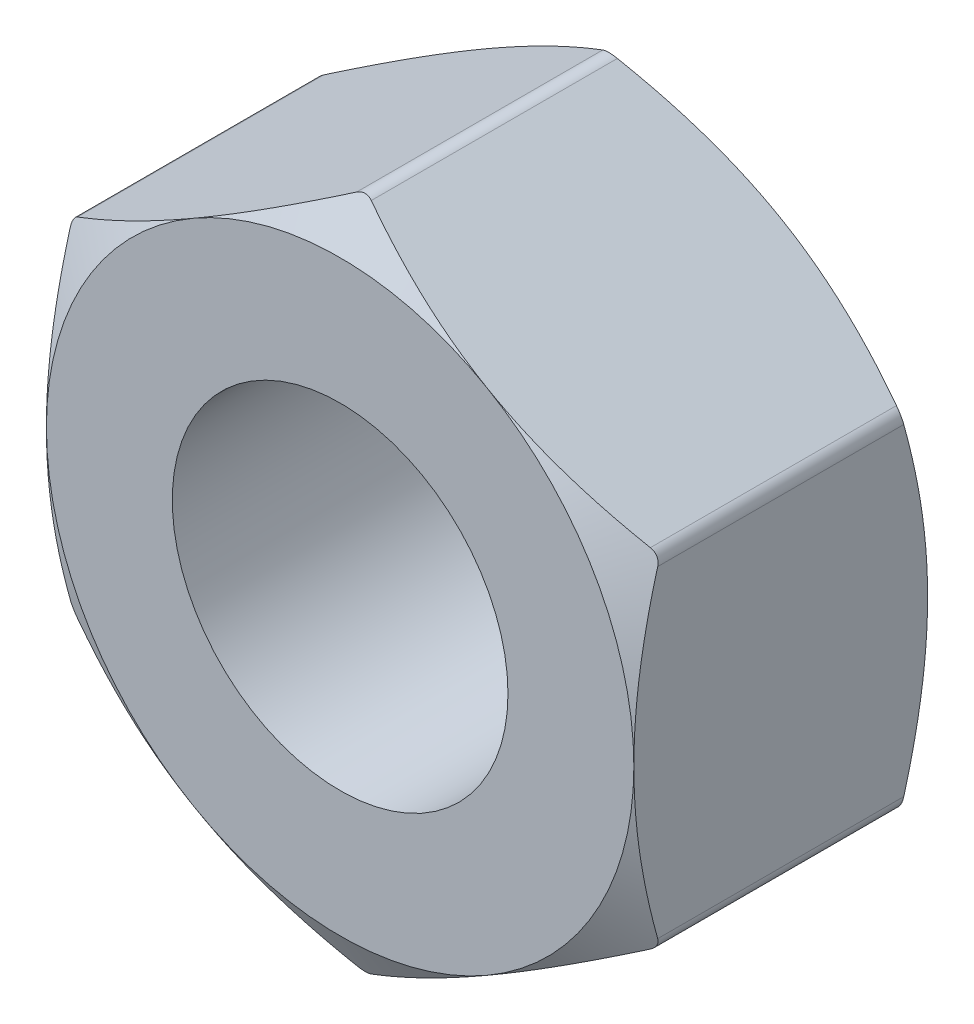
ISO-10303-21;
HEADER;
FILE_DESCRIPTION(('STEP AP214'),'2;1');
FILE_NAME('part.step','',(''),(''),'','','');
FILE_SCHEMA(('AUTOMOTIVE_DESIGN { 1 0 10303 214 1 1 1 1 }'));
ENDSEC;
DATA;
#1=APPLICATION_CONTEXT('core data for automotive mechanical design processes');
#2=APPLICATION_PROTOCOL_DEFINITION('international standard','automotive_design',2000,#1);
#3=PRODUCT_CONTEXT('',#1,'mechanical');
#4=PRODUCT('Part','Part','',(#3));
#5=PRODUCT_RELATED_PRODUCT_CATEGORY('part','',(#4));
#6=PRODUCT_DEFINITION_FORMATION('','',#4);
#7=PRODUCT_DEFINITION_CONTEXT('part definition',#1,'design');
#8=PRODUCT_DEFINITION('design','',#6,#7);
#9=PRODUCT_DEFINITION_SHAPE('','',#8);
#10=(LENGTH_UNIT() NAMED_UNIT(*) SI_UNIT(.MILLI.,.METRE.));
#11=(NAMED_UNIT(*) PLANE_ANGLE_UNIT() SI_UNIT($,.RADIAN.));
#12=(NAMED_UNIT(*) SI_UNIT($,.STERADIAN.) SOLID_ANGLE_UNIT());
#13=UNCERTAINTY_MEASURE_WITH_UNIT(LENGTH_MEASURE(1.E-05),#10,'distance_accuracy_value','');
#14=(GEOMETRIC_REPRESENTATION_CONTEXT(3) GLOBAL_UNCERTAINTY_ASSIGNED_CONTEXT((#13)) GLOBAL_UNIT_ASSIGNED_CONTEXT((#10,
#11,#12)) REPRESENTATION_CONTEXT('',''));
#15=CARTESIAN_POINT('',(0.,0.,0.));
#16=DIRECTION('',(0.,0.,1.));
#17=DIRECTION('',(1.,0.,0.));
#18=AXIS2_PLACEMENT_3D('',#15,#16,#17);
#19=CARTESIAN_POINT('',(-5.27843750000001,3.04750731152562,2.778125));
#20=DIRECTION('',(0.,0.,-1.));
#21=DIRECTION('',(-1.,0.,0.));
#22=AXIS2_PLACEMENT_3D('',#19,#20,#21);
#23=CYLINDRICAL_SURFACE('',#22,0.2778125);
#24=CARTESIAN_POINT('',(-5.41734375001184,3.28809999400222,-2.32728380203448));
#25=CARTESIAN_POINT('',(-5.42918889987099,3.28127933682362,-2.32348152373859));
#26=CARTESIAN_POINT('',(-5.44063916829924,3.27348588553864,-2.32014461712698));
#27=CARTESIAN_POINT('',(-5.46241616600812,3.25613006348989,-2.31450607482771));
#28=CARTESIAN_POINT('',(-5.47274161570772,3.24656571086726,-2.31220560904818));
#29=CARTESIAN_POINT('',(-5.49192971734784,3.22583637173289,-2.30874942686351));
#30=CARTESIAN_POINT('',(-5.50078883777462,3.21466763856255,-2.3075964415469));
#31=CARTESIAN_POINT('',(-5.51670282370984,3.1910742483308,-2.3065001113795));
#32=CARTESIAN_POINT('',(-5.52375965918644,3.17865098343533,-2.30655544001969));
#33=CARTESIAN_POINT('',(-5.53565845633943,3.15336527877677,-2.30784674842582));
#34=CARTESIAN_POINT('',(-5.54056777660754,3.14053228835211,-2.30904237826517));
#35=CARTESIAN_POINT('',(-5.54841770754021,3.11441223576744,-2.31250388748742));
#36=CARTESIAN_POINT('',(-5.55135812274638,3.10112512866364,-2.31476987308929));
#37=CARTESIAN_POINT('',(-5.55429922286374,3.08107278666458,-2.3189119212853));
#38=CARTESIAN_POINT('',(-5.55503457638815,3.07433004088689,-2.32042713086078));
#39=CARTESIAN_POINT('',(-5.55600926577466,3.06088452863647,-2.32368684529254));
#40=CARTESIAN_POINT('',(-5.55625001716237,3.05418170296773,-2.32543068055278));
#41=CARTESIAN_POINT('',(-5.55624999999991,3.04750707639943,-2.32728386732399));
#42=B_SPLINE_CURVE_WITH_KNOTS('',3,(#24,#25,#26,#27,#28,#29,#30,#31,#32,#33,#34,#35,#36,#37,#38,
#39,#40,#41),.UNSPECIFIED.,.F.,.F.,(4,2,2,2,2,2,2,2,4),(0.,0.0425388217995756,
0.0851255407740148,0.127813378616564,0.170454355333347,0.211640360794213,0.252830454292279,
0.273661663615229,0.294433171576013),.UNSPECIFIED.);
#43=CARTESIAN_POINT('',(-5.41734375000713,3.28809999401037,-2.32728380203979));
#44=VERTEX_POINT('',#43);
#45=CARTESIAN_POINT('',(-5.55624999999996,3.04750719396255,-2.32728383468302));
#46=VERTEX_POINT('',#45);
#47=EDGE_CURVE('E19',#44,#46,#42,.T.);
#48=ORIENTED_EDGE('',*,*,#47,.T.);
#49=DIRECTION('',(0.,0.,-1.));
#50=VECTOR('',#49,1.);
#51=CARTESIAN_POINT('',(-5.55625000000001,3.04750731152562,2.778125));
#52=LINE('',#51,#50);
#53=CARTESIAN_POINT('',(-5.55625000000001,3.04750731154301,2.32728380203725));
#54=VERTEX_POINT('',#53);
#55=EDGE_CURVE('E145',#46,#54,#52,.F.);
#56=ORIENTED_EDGE('',*,*,#55,.T.);
#57=CARTESIAN_POINT('',(-5.41734375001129,3.28809999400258,2.32728380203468));
#58=CARTESIAN_POINT('',(-5.42918889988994,3.28127933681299,2.32348152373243));
#59=CARTESIAN_POINT('',(-5.44063916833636,3.27348588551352,2.32014461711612));
#60=CARTESIAN_POINT('',(-5.46241616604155,3.25613006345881,2.31450607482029));
#61=CARTESIAN_POINT('',(-5.47274161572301,3.24656571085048,2.3122056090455));
#62=CARTESIAN_POINT('',(-5.49192971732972,3.22583637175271,2.3087494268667));
#63=CARTESIAN_POINT('',(-5.50078883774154,3.21466763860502,2.307596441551));
#64=CARTESIAN_POINT('',(-5.51670282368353,3.19107424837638,2.3065001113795));
#65=CARTESIAN_POINT('',(-5.52375965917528,3.17865098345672,2.30655544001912));
#66=CARTESIAN_POINT('',(-5.53565845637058,3.15336527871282,2.30784674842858));
#67=CARTESIAN_POINT('',(-5.54056777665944,3.14053228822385,2.30904237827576));
#68=CARTESIAN_POINT('',(-5.54841770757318,3.11441223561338,2.31250388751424));
#69=CARTESIAN_POINT('',(-5.55135812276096,3.10112512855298,2.31476987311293));
#70=CARTESIAN_POINT('',(-5.5542992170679,3.08107282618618,2.31891191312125));
#71=CARTESIAN_POINT('',(-5.55503456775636,3.07433012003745,2.3204271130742));
#72=CARTESIAN_POINT('',(-5.55600925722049,3.06088468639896,2.32368680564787));
#73=CARTESIAN_POINT('',(-5.55625001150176,3.05418189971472,2.32543062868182));
#74=CARTESIAN_POINT('',(-5.55625000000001,3.04750731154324,2.32728380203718));
#75=B_SPLINE_CURVE_WITH_KNOTS('',3,(#57,#58,#59,#60,#61,#62,#63,#64,#65,#66,#67,#68,#69,#70,#71,
#72,#73,#74),.UNSPECIFIED.,.F.,.F.,(4,2,2,2,2,2,2,2,4),(0.,0.0425388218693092,
0.0851255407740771,0.127813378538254,0.170454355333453,0.211640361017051,0.25283045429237,
0.273661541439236,0.294432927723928),.UNSPECIFIED.);
#76=CARTESIAN_POINT('',(-5.41734375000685,3.28809999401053,2.32728380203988));
#77=VERTEX_POINT('',#76);
#78=EDGE_CURVE('E149',#77,#54,#75,.T.);
#79=ORIENTED_EDGE('',*,*,#78,.F.);
#80=DIRECTION('',(0.,0.,1.));
#81=VECTOR('',#80,1.);
#82=CARTESIAN_POINT('',(-5.4173437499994,3.28809999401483,2.778125));
#83=LINE('',#82,#81);
#84=EDGE_CURVE('E147',#77,#44,#83,.F.);
#85=ORIENTED_EDGE('',*,*,#84,.T.);
#86=EDGE_LOOP('',(#48,#56,#79,#85));
#87=FACE_BOUND('',#86,.T.);
#88=ADVANCED_FACE('F15',(#87),#23,.T.);
#89=CARTESIAN_POINT('',(0.,0.,2.30382564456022));
#90=DIRECTION('',(0.,0.,-1.));
#91=DIRECTION('',(-1.,0.,0.));
#92=AXIS2_PLACEMENT_3D('',#89,#90,#91);
#93=CONICAL_SURFACE('',#92,6.37776058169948,1.04719755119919);
#94=CARTESIAN_POINT('',(-5.5562499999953,3.04750731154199,2.32728380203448));
#95=CARTESIAN_POINT('',(-5.55624999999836,2.79904197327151,2.39629919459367));
#96=CARTESIAN_POINT('',(-5.55624999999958,2.54868562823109,2.45930885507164));
#97=CARTESIAN_POINT('',(-5.55625000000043,2.04589867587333,2.57017545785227));
#98=CARTESIAN_POINT('',(-5.55625000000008,1.7934833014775,2.61810207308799));
#99=CARTESIAN_POINT('',(-5.55624999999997,1.41268763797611,2.67681910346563));
#100=CARTESIAN_POINT('',(-5.55625,1.28532162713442,2.69420200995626));
#101=CARTESIAN_POINT('',(-5.55625000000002,1.03003393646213,2.72426534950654));
#102=CARTESIAN_POINT('',(-5.55625000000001,0.902112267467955,2.73694587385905));
#103=CARTESIAN_POINT('',(-5.55625,0.645274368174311,2.7574020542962));
#104=CARTESIAN_POINT('',(-5.55625,0.516356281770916,2.76515456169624));
#105=CARTESIAN_POINT('',(-5.55625000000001,0.258293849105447,2.77552567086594));
#106=CARTESIAN_POINT('',(-5.55625000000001,0.129149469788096,2.77814344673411));
#107=CARTESIAN_POINT('',(-5.55625000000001,3.24552810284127E-13,2.7781250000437));
#108=B_SPLINE_CURVE_WITH_KNOTS('',3,(#94,#95,#96,#97,#98,#99,#100,#101,#102,#103,#104,#105,#106,
#107),.UNSPECIFIED.,.F.,.F.,(4,2,2,2,2,2,4),(0.,0.773885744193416,1.54414235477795,
1.92970325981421,2.31525667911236,2.70260805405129,3.09002172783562),.UNSPECIFIED.);
#109=CARTESIAN_POINT('',(-5.55625000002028,0.,2.77812500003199));
#110=VERTEX_POINT('',#109);
#111=EDGE_CURVE('E159',#54,#110,#108,.T.);
#112=ORIENTED_EDGE('',*,*,#111,.T.);
#113=CARTESIAN_POINT('',(0.,0.,2.77812500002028));
#114=DIRECTION('',(0.,0.,-1.));
#115=DIRECTION('',(-1.,0.,0.));
#116=AXIS2_PLACEMENT_3D('',#113,#114,#115);
#117=CIRCLE('',#116,5.55625000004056);
#118=CARTESIAN_POINT('',(-2.77812500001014,4.81185364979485,2.77812500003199));
#119=VERTEX_POINT('',#118);
#120=EDGE_CURVE('E351',#119,#110,#117,.F.);
#121=ORIENTED_EDGE('',*,*,#120,.F.);
#122=CARTESIAN_POINT('',(-2.77812499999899,4.81185364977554,2.77812500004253));
#123=CARTESIAN_POINT('',(-2.88997172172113,4.74727891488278,2.77814344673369));
#124=CARTESIAN_POINT('',(-3.00181403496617,4.68270672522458,2.77552567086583));
#125=CARTESIAN_POINT('',(-3.22530265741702,4.55367550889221,2.76515456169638));
#126=CARTESIAN_POINT('',(-3.33694899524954,4.48921646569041,2.75740205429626));
#127=CARTESIAN_POINT('',(-3.55937714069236,4.36079751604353,2.73694587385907));
#128=CARTESIAN_POINT('',(-3.67016055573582,4.29683668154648,2.72426534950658));
#129=CARTESIAN_POINT('',(-3.89124618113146,4.16919283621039,2.69420200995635));
#130=CARTESIAN_POINT('',(-4.00154838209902,4.10550983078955,2.67681910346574));
#131=CARTESIAN_POINT('',(-4.33132710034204,3.91511199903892,2.61810207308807));
#132=CARTESIAN_POINT('',(-4.54992522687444,3.78890431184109,2.57017545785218));
#133=CARTESIAN_POINT('',(-4.98535150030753,3.53751083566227,2.45930885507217));
#134=CARTESIAN_POINT('',(-5.2021664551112,3.41233266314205,2.39629919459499));
#135=CARTESIAN_POINT('',(-5.41734375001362,3.28809999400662,2.32728380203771));
#136=B_SPLINE_CURVE_WITH_KNOTS('',3,(#122,#123,#124,#125,#126,#127,#128,#129,#130,#131,#132,
#133,#134,#135),.UNSPECIFIED.,.F.,.F.,(4,2,2,2,2,2,4),(0.,0.387413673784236,0.774765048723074,
1.16031846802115,1.54587937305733,2.3161359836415,3.09002172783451),.UNSPECIFIED.);
#137=EDGE_CURVE('E363',#119,#77,#136,.T.);
#138=ORIENTED_EDGE('',*,*,#137,.T.);
#139=ORIENTED_EDGE('',*,*,#78,.T.);
#140=EDGE_LOOP('',(#112,#121,#138,#139));
#141=FACE_BOUND('',#140,.T.);
#142=ADVANCED_FACE('F491',(#141),#93,.T.);
#143=CARTESIAN_POINT('',(-5.27843750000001,-3.0475073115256,2.778125));
#144=DIRECTION('',(0.,0.,-1.));
#145=DIRECTION('',(-1.,0.,0.));
#146=AXIS2_PLACEMENT_3D('',#143,#144,#145);
#147=CYLINDRICAL_SURFACE('',#146,0.2778125);
#148=CARTESIAN_POINT('',(-5.55624999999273,-3.04750731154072,-2.32728380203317));
#149=CARTESIAN_POINT('',(-5.55626571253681,-3.06117584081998,-2.32348152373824));
#150=CARTESIAN_POINT('',(-5.5552415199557,-3.07498878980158,-2.32014461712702));
#151=CARTESIAN_POINT('',(-5.55109943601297,-3.10252613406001,-2.31450607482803));
#152=CARTESIAN_POINT('',(-5.5479791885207,-3.11625041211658,-2.31220560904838));
#153=CARTESIAN_POINT('',(-5.53962110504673,-3.14323246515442,-2.30874942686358));
#154=CARTESIAN_POINT('',(-5.53437825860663,-3.15648905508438,-2.30759644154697));
#155=CARTESIAN_POINT('',(-5.52190277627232,-3.18206766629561,-2.30650011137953));
#156=CARTESIAN_POINT('',(-5.51467233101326,-3.19439069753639,-2.30655544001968));
#157=CARTESIAN_POINT('',(-5.498723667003,-3.21733821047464,-2.30784674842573));
#158=CARTESIAN_POINT('',(-5.49006463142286,-3.22800630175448,-2.30904237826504));
#159=CARTESIAN_POINT('',(-5.47136896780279,-3.24786456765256,-2.31250388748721));
#160=CARTESIAN_POINT('',(-5.4613322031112,-3.25705459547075,-2.31476987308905));
#161=CARTESIAN_POINT('',(-5.4454369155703,-3.2696278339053,-2.31891192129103));
#162=CARTESIAN_POINT('',(-5.43996520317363,-3.27363604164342,-2.32042713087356));
#163=CARTESIAN_POINT('',(-5.42880839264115,-3.28120290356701,-2.32368684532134));
#164=CARTESIAN_POINT('',(-5.4231239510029,-3.28476281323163,-2.32543068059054));
#165=CARTESIAN_POINT('',(-5.41734354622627,-3.28810011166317,-2.32728386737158));
#166=B_SPLINE_CURVE_WITH_KNOTS('',3,(#148,#149,#150,#151,#152,#153,#154,#155,#156,#157,#158,
#159,#160,#161,#162,#163,#164,#165),.UNSPECIFIED.,.F.,.F.,(4,2,2,2,2,2,2,2,4),(0.,
0.0425388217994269,0.0851255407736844,0.127813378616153,0.170454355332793,0.211640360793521,
0.252830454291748,0.27366166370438,0.294433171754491),.UNSPECIFIED.);
#167=CARTESIAN_POINT('',(-5.55625000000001,-3.04750731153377,-2.32728380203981));
#168=VERTEX_POINT('',#167);
#169=CARTESIAN_POINT('',(-5.41734364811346,-3.28810005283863,-2.32728383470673));
#170=VERTEX_POINT('',#169);
#171=EDGE_CURVE('E577',#168,#170,#166,.T.);
#172=ORIENTED_EDGE('',*,*,#171,.T.);
#173=DIRECTION('',(0.,0.,1.));
#174=VECTOR('',#173,1.);
#175=CARTESIAN_POINT('',(-5.41734375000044,-3.28809999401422,2.778125));
#176=LINE('',#175,#174);
#177=CARTESIAN_POINT('',(-5.41734375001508,-3.28809999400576,2.32728380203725));
#178=VERTEX_POINT('',#177);
#179=EDGE_CURVE('E413',#170,#178,#176,.T.);
#180=ORIENTED_EDGE('',*,*,#179,.T.);
#181=CARTESIAN_POINT('',(-5.55624999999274,-3.04750731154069,2.32728380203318));
#182=CARTESIAN_POINT('',(-5.55626571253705,-3.06117584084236,2.32348152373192));
#183=CARTESIAN_POINT('',(-5.55524151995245,-3.07498878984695,2.32014461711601));
#184=CARTESIAN_POINT('',(-5.55109943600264,-3.10252613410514,2.31450607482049));
#185=CARTESIAN_POINT('',(-5.54797918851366,-3.11625041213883,2.3122056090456));
#186=CARTESIAN_POINT('',(-5.53962110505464,-3.14323246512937,2.30874942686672));
#187=CARTESIAN_POINT('',(-5.53437825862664,-3.156489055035,2.30759644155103));
#188=CARTESIAN_POINT('',(-5.52190277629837,-3.18206766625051,2.30650011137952));
#189=CARTESIAN_POINT('',(-5.51467233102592,-3.19439069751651,2.30655544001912));
#190=CARTESIAN_POINT('',(-5.49872366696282,-3.21733821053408,2.30784674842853));
#191=CARTESIAN_POINT('',(-5.4900646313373,-3.22800630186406,2.30904237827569));
#192=CARTESIAN_POINT('',(-5.47136896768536,-3.2478645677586,2.31250388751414));
#193=CARTESIAN_POINT('',(-5.46133220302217,-3.25705459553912,2.31476987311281));
#194=CARTESIAN_POINT('',(-5.44543694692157,-3.26962780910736,2.31891191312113));
#195=CARTESIAN_POINT('',(-5.43996526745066,-3.2736359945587,2.3204271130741));
#196=CARTESIAN_POINT('',(-5.42880852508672,-3.28120281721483,2.32368680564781));
#197=CARTESIAN_POINT('',(-5.42312411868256,-3.28476270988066,2.32543062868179));
#198=CARTESIAN_POINT('',(-5.41734375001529,-3.28809999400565,2.32728380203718));
#199=B_SPLINE_CURVE_WITH_KNOTS('',3,(#181,#182,#183,#184,#185,#186,#187,#188,#189,#190,#191,
#192,#193,#194,#195,#196,#197,#198),.UNSPECIFIED.,.F.,.F.,(4,2,2,2,2,2,2,2,4),(0.,
0.0425388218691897,0.0851255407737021,0.127813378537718,0.170454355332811,0.211640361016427,
0.252830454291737,0.273661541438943,0.294432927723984),.UNSPECIFIED.);
#200=CARTESIAN_POINT('',(-5.55625000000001,-3.04750731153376,2.32728380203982));
#201=VERTEX_POINT('',#200);
#202=EDGE_CURVE('E455',#201,#178,#199,.T.);
#203=ORIENTED_EDGE('',*,*,#202,.F.);
#204=DIRECTION('',(0.,0.,-1.));
#205=VECTOR('',#204,1.);
#206=CARTESIAN_POINT('',(-5.55625000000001,-3.04750731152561,2.778125));
#207=LINE('',#206,#205);
#208=EDGE_CURVE('E160',#201,#168,#207,.T.);
#209=ORIENTED_EDGE('',*,*,#208,.T.);
#210=EDGE_LOOP('',(#172,#180,#203,#209));
#211=FACE_BOUND('',#210,.T.);
#212=ADVANCED_FACE('F472',(#211),#147,.T.);
#213=CARTESIAN_POINT('',(0.,0.,2.30382564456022));
#214=DIRECTION('',(0.,0.,-1.));
#215=DIRECTION('',(-1.,0.,0.));
#216=AXIS2_PLACEMENT_3D('',#213,#214,#215);
#217=CONICAL_SURFACE('',#216,6.37776058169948,1.04719755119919);
#218=CARTESIAN_POINT('',(-5.41734375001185,-3.2880999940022,2.32728380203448));
#219=CARTESIAN_POINT('',(-5.20216645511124,-3.41233266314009,2.39629919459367));
#220=CARTESIAN_POINT('',(-4.98535150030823,-3.53751083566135,2.45930885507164));
#221=CARTESIAN_POINT('',(-4.54992522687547,-3.78890431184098,2.57017545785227));
#222=CARTESIAN_POINT('',(-4.33132710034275,-3.91511199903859,2.618102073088));
#223=CARTESIAN_POINT('',(-4.00154838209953,-4.10550983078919,2.67681910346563));
#224=CARTESIAN_POINT('',(-3.89124618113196,-4.16919283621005,2.69420200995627));
#225=CARTESIAN_POINT('',(-3.6701605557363,-4.29683668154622,2.72426534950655));
#226=CARTESIAN_POINT('',(-3.55937714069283,-4.3607975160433,2.73694587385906));
#227=CARTESIAN_POINT('',(-3.3369489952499,-4.48921646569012,2.75740205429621));
#228=CARTESIAN_POINT('',(-3.22530265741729,-4.55367550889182,2.76515456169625));
#229=CARTESIAN_POINT('',(-3.00181403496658,-4.68270672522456,2.77552567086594));
#230=CARTESIAN_POINT('',(-2.88997172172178,-4.74727891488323,2.77814344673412));
#231=CARTESIAN_POINT('',(-2.77812500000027,-4.81185364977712,2.77812500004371));
#232=B_SPLINE_CURVE_WITH_KNOTS('',3,(#218,#219,#220,#221,#222,#223,#224,#225,#226,#227,#228,
#229,#230,#231),.UNSPECIFIED.,.F.,.F.,(4,2,2,2,2,2,4),(0.,0.773885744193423,1.54414235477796,
1.92970325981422,2.31525667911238,2.70260805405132,3.09002172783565),.UNSPECIFIED.);
#233=CARTESIAN_POINT('',(-2.77812500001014,-4.81185364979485,2.77812500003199));
#234=VERTEX_POINT('',#233);
#235=EDGE_CURVE('E429',#178,#234,#232,.T.);
#236=ORIENTED_EDGE('',*,*,#235,.T.);
#237=CARTESIAN_POINT('',(0.,0.,2.77812500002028));
#238=DIRECTION('',(0.,0.,-1.));
#239=DIRECTION('',(-1.,0.,0.));
#240=AXIS2_PLACEMENT_3D('',#237,#238,#239);
#241=CIRCLE('',#240,5.55625000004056);
#242=EDGE_CURVE('E353',#110,#234,#241,.F.);
#243=ORIENTED_EDGE('',*,*,#242,.F.);
#244=CARTESIAN_POINT('',(-5.55624999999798,0.,2.77812500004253));
#245=CARTESIAN_POINT('',(-5.55624999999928,-0.129149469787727,2.77814344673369));
#246=CARTESIAN_POINT('',(-5.55624999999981,-0.258293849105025,2.77552567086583));
#247=CARTESIAN_POINT('',(-5.5562500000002,-0.51635628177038,2.76515456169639));
#248=CARTESIAN_POINT('',(-5.55625000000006,-0.645274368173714,2.75740205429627));
#249=CARTESIAN_POINT('',(-5.55624999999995,-0.902112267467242,2.73694587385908));
#250=CARTESIAN_POINT('',(-5.55624999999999,-1.03003393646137,2.72426534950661));
#251=CARTESIAN_POINT('',(-5.55625000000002,-1.28532162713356,2.69420200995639));
#252=CARTESIAN_POINT('',(-5.55625000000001,-1.41268763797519,2.67681910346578));
#253=CARTESIAN_POINT('',(-5.55625,-1.79348330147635,2.61810207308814));
#254=CARTESIAN_POINT('',(-5.55625,-2.04589867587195,2.57017545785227));
#255=CARTESIAN_POINT('',(-5.55625000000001,-2.5486856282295,2.4593088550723));
#256=CARTESIAN_POINT('',(-5.55625000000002,-2.79904197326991,2.39629919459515));
#257=CARTESIAN_POINT('',(-5.55625000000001,-3.04750731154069,2.32728380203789));
#258=B_SPLINE_CURVE_WITH_KNOTS('',3,(#244,#245,#246,#247,#248,#249,#250,#251,#252,#253,#254,
#255,#256,#257),.UNSPECIFIED.,.F.,.F.,(4,2,2,2,2,2,4),(0.,0.387413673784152,0.774765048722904,
1.1603184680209,1.54587937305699,2.31613598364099,3.09002172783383),.UNSPECIFIED.);
#259=EDGE_CURVE('E478',#110,#201,#258,.T.);
#260=ORIENTED_EDGE('',*,*,#259,.T.);
#261=ORIENTED_EDGE('',*,*,#202,.T.);
#262=EDGE_LOOP('',(#236,#243,#260,#261));
#263=FACE_BOUND('',#262,.T.);
#264=ADVANCED_FACE('F467',(#263),#217,.T.);
#265=CARTESIAN_POINT('',(0.,-6.09501462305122,2.778125));
#266=DIRECTION('',(0.,0.,-1.));
#267=DIRECTION('',(-1.,0.,0.));
#268=AXIS2_PLACEMENT_3D('',#265,#266,#267);
#269=CYLINDRICAL_SURFACE('',#268,0.2778125);
#270=CARTESIAN_POINT('',(-0.138906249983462,-6.33560730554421,-2.32728380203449));
#271=CARTESIAN_POINT('',(-0.127076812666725,-6.34245517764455,-2.3234815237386));
#272=CARTESIAN_POINT('',(-0.114602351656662,-6.34847467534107,-2.32014461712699));
#273=CARTESIAN_POINT('',(-0.0886832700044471,-6.35865619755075,-2.31450607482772));
#274=CARTESIAN_POINT('',(-0.0752375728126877,-6.36281612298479,-2.31220560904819));
#275=CARTESIAN_POINT('',(-0.0476913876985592,-6.36906883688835,-2.30874942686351));
#276=CARTESIAN_POINT('',(-0.0335894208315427,-6.37115669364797,-2.30759644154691));
#277=CARTESIAN_POINT('',(-0.00519995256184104,-6.37314191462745,-2.30650011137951));
#278=CARTESIAN_POINT('',(0.00908732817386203,-6.37304168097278,-2.3065554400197));
#279=CARTESIAN_POINT('',(0.036934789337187,-6.37070348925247,-2.30784674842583));
#280=CARTESIAN_POINT('',(0.0505031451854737,-6.36853859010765,-2.30904237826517));
#281=CARTESIAN_POINT('',(0.0770487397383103,-6.36227680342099,-2.31250388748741));
#282=CARTESIAN_POINT('',(0.0900259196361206,-6.3581797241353,-2.31476987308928));
#283=CARTESIAN_POINT('',(0.108862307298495,-6.3507006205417,-2.31891192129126));
#284=CARTESIAN_POINT('',(0.115069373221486,-6.3479660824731,-2.32042713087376));
#285=CARTESIAN_POINT('',(0.127200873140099,-6.34208743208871,-2.32368684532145));
#286=CARTESIAN_POINT('',(0.133126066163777,-6.33894451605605,-2.3254306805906));
#287=CARTESIAN_POINT('',(0.138906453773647,-6.33560718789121,-2.32728386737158));
#288=B_SPLINE_CURVE_WITH_KNOTS('',3,(#270,#271,#272,#273,#274,#275,#276,#277,#278,#279,#280,
#281,#282,#283,#284,#285,#286,#287),.UNSPECIFIED.,.F.,.F.,(4,2,2,2,2,2,2,2,4),(0.,
0.0425388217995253,0.0851255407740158,0.127813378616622,0.170454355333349,0.211640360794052,
0.25283045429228,0.273661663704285,0.294433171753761),.UNSPECIFIED.);
#289=CARTESIAN_POINT('',(-0.138906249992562,-6.33560730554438,-2.3272838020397));
#290=VERTEX_POINT('',#289);
#291=CARTESIAN_POINT('',(0.138906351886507,-6.33560724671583,-2.32728383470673));
#292=VERTEX_POINT('',#291);
#293=EDGE_CURVE('E402',#290,#292,#288,.T.);
#294=ORIENTED_EDGE('',*,*,#293,.T.);
#295=DIRECTION('',(0.,0.,1.));
#296=VECTOR('',#295,1.);
#297=CARTESIAN_POINT('',(0.138906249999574,-6.33560730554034,2.778125));
#298=LINE('',#297,#296);
#299=CARTESIAN_POINT('',(0.138906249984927,-6.33560730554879,2.32728380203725));
#300=VERTEX_POINT('',#299);
#301=EDGE_CURVE('E514',#292,#300,#298,.T.);
#302=ORIENTED_EDGE('',*,*,#301,.T.);
#303=CARTESIAN_POINT('',(-0.13890624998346,-6.33560730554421,2.32728380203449));
#304=CARTESIAN_POINT('',(-0.12707681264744,-6.34245517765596,2.32348152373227));
#305=CARTESIAN_POINT('',(-0.114602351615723,-6.34847467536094,2.32014461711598));
#306=CARTESIAN_POINT('',(-0.0886832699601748,-6.35865619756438,2.31450607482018));
#307=CARTESIAN_POINT('',(-0.0752375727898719,-6.36281612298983,2.31220560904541));
#308=CARTESIAN_POINT('',(-0.0476913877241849,-6.36906883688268,2.30874942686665));
#309=CARTESIAN_POINT('',(-0.0335894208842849,-6.37115669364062,2.30759644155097));
#310=CARTESIAN_POINT('',(-0.00519995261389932,-6.37314191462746,2.3065001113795));
#311=CARTESIAN_POINT('',(0.00908732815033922,-6.3730416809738,2.30655544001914));
#312=CARTESIAN_POINT('',(0.0369347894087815,-6.37070348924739,2.30784674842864));
#313=CARTESIAN_POINT('',(0.050503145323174,-6.36853859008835,2.30904237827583));
#314=CARTESIAN_POINT('',(0.0770487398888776,-6.36227680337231,2.31250388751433));
#315=CARTESIAN_POINT('',(0.090025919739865,-6.35817972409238,2.31476987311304));
#316=CARTESIAN_POINT('',(0.108862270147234,-6.35070063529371,2.31891191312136));
#317=CARTESIAN_POINT('',(0.115069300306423,-6.34796611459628,2.3204271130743));
#318=CARTESIAN_POINT('',(0.127200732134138,-6.34208750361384,2.32368680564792));
#319=CARTESIAN_POINT('',(0.133125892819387,-6.33894460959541,2.32543062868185));
#320=CARTESIAN_POINT('',(0.138906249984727,-6.33560730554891,2.32728380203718));
#321=B_SPLINE_CURVE_WITH_KNOTS('',3,(#303,#304,#305,#306,#307,#308,#309,#310,#311,#312,#313,
#314,#315,#316,#317,#318,#319,#320),.UNSPECIFIED.,.F.,.F.,(4,2,2,2,2,2,2,2,4),(0.,
0.0425388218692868,0.08512554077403,0.127813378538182,0.170454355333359,0.211640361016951,
0.252830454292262,0.273661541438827,0.294432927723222),.UNSPECIFIED.);
#322=CARTESIAN_POINT('',(-0.138906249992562,-6.33560730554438,2.3272838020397));
#323=VERTEX_POINT('',#322);
#324=EDGE_CURVE('E454',#323,#300,#321,.T.);
#325=ORIENTED_EDGE('',*,*,#324,.F.);
#326=DIRECTION('',(0.,0.,1.));
#327=VECTOR('',#326,1.);
#328=CARTESIAN_POINT('',(-0.138906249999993,-6.33560730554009,2.778125));
#329=LINE('',#328,#327);
#330=EDGE_CURVE('E505',#323,#290,#329,.F.);
#331=ORIENTED_EDGE('',*,*,#330,.T.);
#332=EDGE_LOOP('',(#294,#302,#325,#331));
#333=FACE_BOUND('',#332,.T.);
#334=ADVANCED_FACE('F464',(#333),#269,.T.);
#335=CARTESIAN_POINT('',(0.,0.,2.30382564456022));
#336=DIRECTION('',(0.,0.,-1.));
#337=DIRECTION('',(-1.,0.,0.));
#338=AXIS2_PLACEMENT_3D('',#335,#336,#337);
#339=CONICAL_SURFACE('',#338,6.37776058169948,1.04719755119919);
#340=CARTESIAN_POINT('',(0.138906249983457,-6.33560730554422,2.32728380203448));
#341=CARTESIAN_POINT('',(0.354083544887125,-6.21137463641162,2.39629919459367));
#342=CARTESIAN_POINT('',(0.57089849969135,-6.08619646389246,2.45930885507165));
#343=CARTESIAN_POINT('',(1.00632477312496,-5.83480298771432,2.57017545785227));
#344=CARTESIAN_POINT('',(1.22492289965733,-5.70859530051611,2.618102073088));
#345=CARTESIAN_POINT('',(1.55470161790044,-5.5181974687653,2.67681910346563));
#346=CARTESIAN_POINT('',(1.66500381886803,-5.45451446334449,2.69420200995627));
#347=CARTESIAN_POINT('',(1.88608944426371,-5.32687061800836,2.72426534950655));
#348=CARTESIAN_POINT('',(1.99687285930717,-5.26290978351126,2.73694587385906));
#349=CARTESIAN_POINT('',(2.21930100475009,-5.13449083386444,2.75740205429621));
#350=CARTESIAN_POINT('',(2.33094734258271,-5.07003179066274,2.76515456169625));
#351=CARTESIAN_POINT('',(2.55443596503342,-4.94100057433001,2.77552567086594));
#352=CARTESIAN_POINT('',(2.66627827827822,-4.87642838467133,2.77814344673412));
#353=CARTESIAN_POINT('',(2.77812499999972,-4.81185364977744,2.7781250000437));
#354=B_SPLINE_CURVE_WITH_KNOTS('',3,(#340,#341,#342,#343,#344,#345,#346,#347,#348,#349,#350,
#351,#352,#353),.UNSPECIFIED.,.F.,.F.,(4,2,2,2,2,2,4),(0.,0.773885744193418,1.54414235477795,
1.92970325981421,2.31525667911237,2.70260805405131,3.09002172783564),.UNSPECIFIED.);
#355=CARTESIAN_POINT('',(2.77812500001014,-4.81185364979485,2.77812500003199));
#356=VERTEX_POINT('',#355);
#357=EDGE_CURVE('E265',#300,#356,#354,.T.);
#358=ORIENTED_EDGE('',*,*,#357,.T.);
#359=CARTESIAN_POINT('',(0.,0.,2.77812500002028));
#360=DIRECTION('',(0.,0.,-1.));
#361=DIRECTION('',(-1.,0.,0.));
#362=AXIS2_PLACEMENT_3D('',#359,#360,#361);
#363=CIRCLE('',#362,5.55625000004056);
#364=EDGE_CURVE('E354',#234,#356,#363,.F.);
#365=ORIENTED_EDGE('',*,*,#364,.F.);
#366=CARTESIAN_POINT('',(-2.77812499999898,-4.81185364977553,2.77812500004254));
#367=CARTESIAN_POINT('',(-2.66627827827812,-4.87642838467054,2.7781434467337));
#368=CARTESIAN_POINT('',(-2.55443596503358,-4.94100057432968,2.77552567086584));
#369=CARTESIAN_POINT('',(-2.33094734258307,-5.07003179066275,2.76515456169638));
#370=CARTESIAN_POINT('',(-2.21930100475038,-5.13449083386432,2.75740205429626));
#371=CARTESIAN_POINT('',(-1.99687285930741,-5.26290978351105,2.73694587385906));
#372=CARTESIAN_POINT('',(-1.88608944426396,-5.32687061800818,2.72426534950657));
#373=CARTESIAN_POINT('',(-1.6650038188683,-5.45451446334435,2.69420200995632));
#374=CARTESIAN_POINT('',(-1.55470161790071,-5.51819746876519,2.67681910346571));
#375=CARTESIAN_POINT('',(-1.22492289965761,-5.70859530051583,2.61810207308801));
#376=CARTESIAN_POINT('',(-1.00632477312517,-5.83480298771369,2.5701754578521));
#377=CARTESIAN_POINT('',(-0.570898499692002,-6.08619646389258,2.45930885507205));
#378=CARTESIAN_POINT('',(-0.354083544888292,-6.21137463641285,2.39629919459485));
#379=CARTESIAN_POINT('',(-0.13890624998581,-6.33560730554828,2.32728380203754));
#380=B_SPLINE_CURVE_WITH_KNOTS('',3,(#366,#367,#368,#369,#370,#371,#372,#373,#374,#375,#376,
#377,#378,#379),.UNSPECIFIED.,.F.,.F.,(4,2,2,2,2,2,4),(0.,0.387413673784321,0.774765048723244,
1.16031846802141,1.54587937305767,2.31613598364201,3.09002172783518),.UNSPECIFIED.);
#381=EDGE_CURVE('E500',#234,#323,#380,.T.);
#382=ORIENTED_EDGE('',*,*,#381,.T.);
#383=ORIENTED_EDGE('',*,*,#324,.T.);
#384=EDGE_LOOP('',(#358,#365,#382,#383));
#385=FACE_BOUND('',#384,.T.);
#386=ADVANCED_FACE('F243',(#385),#339,.T.);
#387=CARTESIAN_POINT('',(0.,0.,2.30382564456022));
#388=DIRECTION('',(0.,0.,-1.));
#389=DIRECTION('',(-1.,0.,0.));
#390=AXIS2_PLACEMENT_3D('',#387,#388,#389);
#391=CONICAL_SURFACE('',#390,6.37776058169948,1.04719755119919);
#392=CARTESIAN_POINT('',(-0.138906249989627,6.33560730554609,2.32728380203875));
#393=CARTESIAN_POINT('',(-0.354083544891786,6.21137463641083,2.39629919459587));
#394=CARTESIAN_POINT('',(-0.570898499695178,6.08619646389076,2.45930885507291));
#395=CARTESIAN_POINT('',(-1.00632477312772,5.83480298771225,2.57017545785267));
#396=CARTESIAN_POINT('',(-1.22492289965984,5.70859530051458,2.61810207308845));
#397=CARTESIAN_POINT('',(-1.55470161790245,5.5181974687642,2.67681910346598));
#398=CARTESIAN_POINT('',(-1.66500381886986,5.45451446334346,2.69420200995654));
#399=CARTESIAN_POINT('',(-1.88608944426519,5.32687061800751,2.72426534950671));
#400=CARTESIAN_POINT('',(-1.99687285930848,5.26290978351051,2.73694587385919));
#401=CARTESIAN_POINT('',(-2.21930100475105,5.1344908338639,2.75740205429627));
#402=CARTESIAN_POINT('',(-2.33094734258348,5.07003179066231,2.76515456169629));
#403=CARTESIAN_POINT('',(-2.55443596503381,4.94100057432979,2.77552567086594));
#404=CARTESIAN_POINT('',(-2.66627827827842,4.87642838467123,2.77814344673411));
#405=CARTESIAN_POINT('',(-2.77812499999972,4.81185364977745,2.7781250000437));
#406=B_SPLINE_CURVE_WITH_KNOTS('',3,(#392,#393,#394,#395,#396,#397,#398,#399,#400,#401,#402,
#403,#404,#405),.UNSPECIFIED.,.F.,.F.,(4,2,2,2,2,2,4),(0.,0.773885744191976,1.54414235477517,
1.92970325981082,2.31525667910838,2.70260805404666,3.09002172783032),.UNSPECIFIED.);
#407=CARTESIAN_POINT('',(-0.138906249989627,6.33560730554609,2.32728380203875));
#408=VERTEX_POINT('',#407);
#409=EDGE_CURVE('E250',#408,#119,#406,.T.);
#410=ORIENTED_EDGE('',*,*,#409,.T.);
#411=CARTESIAN_POINT('',(0.,0.,2.77812500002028));
#412=DIRECTION('',(0.,0.,-1.));
#413=DIRECTION('',(-1.,0.,0.));
#414=AXIS2_PLACEMENT_3D('',#411,#412,#413);
#415=CIRCLE('',#414,5.55625000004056);
#416=CARTESIAN_POINT('',(2.77812500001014,4.81185364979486,2.77812500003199));
#417=VERTEX_POINT('',#416);
#418=EDGE_CURVE('E349',#417,#119,#415,.F.);
#419=ORIENTED_EDGE('',*,*,#418,.F.);
#420=CARTESIAN_POINT('',(2.77812499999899,4.81185364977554,2.77812500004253));
#421=CARTESIAN_POINT('',(2.66627827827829,4.87642838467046,2.77814344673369));
#422=CARTESIAN_POINT('',(2.55443596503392,4.9410005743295,2.77552567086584));
#423=CARTESIAN_POINT('',(2.33094734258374,5.07003179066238,2.76515456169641));
#424=CARTESIAN_POINT('',(2.21930100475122,5.13449083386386,2.75740205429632));
#425=CARTESIAN_POINT('',(1.99687285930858,5.2629097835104,2.73694587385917));
#426=CARTESIAN_POINT('',(1.88608944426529,5.32687061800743,2.72426534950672));
#427=CARTESIAN_POINT('',(1.66500381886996,5.45451446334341,2.69420200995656));
#428=CARTESIAN_POINT('',(1.55470161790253,5.51819746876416,2.67681910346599));
#429=CARTESIAN_POINT('',(1.2249228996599,5.70859530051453,2.61810207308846));
#430=CARTESIAN_POINT('',(1.00632477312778,5.83480298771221,2.57017545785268));
#431=CARTESIAN_POINT('',(0.570898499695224,6.08619646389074,2.45930885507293));
#432=CARTESIAN_POINT('',(0.35408354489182,6.21137463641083,2.39629919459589));
#433=CARTESIAN_POINT('',(0.138906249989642,6.33560730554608,2.32728380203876));
#434=B_SPLINE_CURVE_WITH_KNOTS('',3,(#420,#421,#422,#423,#424,#425,#426,#427,#428,#429,#430,
#431,#432,#433),.UNSPECIFIED.,.F.,.F.,(4,2,2,2,2,2,4),(0.,0.387413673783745,0.77476504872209,
1.16031846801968,1.54587937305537,2.31613598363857,3.0900217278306),.UNSPECIFIED.);
#435=CARTESIAN_POINT('',(0.138906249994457,6.3356073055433,2.3272838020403));
#436=VERTEX_POINT('',#435);
#437=EDGE_CURVE('E257',#417,#436,#434,.T.);
#438=ORIENTED_EDGE('',*,*,#437,.T.);
#439=CARTESIAN_POINT('',(-0.138906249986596,6.33560730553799,2.32728380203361));
#440=CARTESIAN_POINT('',(-0.127076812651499,6.34245517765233,2.32348152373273));
#441=CARTESIAN_POINT('',(-0.114602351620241,6.34847467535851,2.32014461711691));
#442=CARTESIAN_POINT('',(-0.0886832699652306,6.35865619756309,2.31450607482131));
#443=CARTESIAN_POINT('',(-0.0752375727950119,6.3628161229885,2.31220560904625));
#444=CARTESIAN_POINT('',(-0.0476913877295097,6.36906883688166,2.3087494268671));
#445=CARTESIAN_POINT('',(-0.0335894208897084,6.37115669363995,2.30759644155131));
#446=CARTESIAN_POINT('',(-0.00519995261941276,6.3731419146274,2.30650011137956));
#447=CARTESIAN_POINT('',(0.00908732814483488,6.373041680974,2.30655544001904));
#448=CARTESIAN_POINT('',(0.0369347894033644,6.37070348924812,2.30784674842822));
#449=CARTESIAN_POINT('',(0.0505031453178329,6.36853859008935,2.30904237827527));
#450=CARTESIAN_POINT('',(0.0770487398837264,6.36227680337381,2.31250388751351));
#451=CARTESIAN_POINT('',(0.0900259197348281,6.35817972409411,2.31476987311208));
#452=CARTESIAN_POINT('',(0.108862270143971,6.35070063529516,2.31891191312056));
#453=CARTESIAN_POINT('',(0.115069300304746,6.34796611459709,2.32042711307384));
#454=CARTESIAN_POINT('',(0.127200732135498,6.3420875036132,2.32368680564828));
#455=CARTESIAN_POINT('',(0.1331258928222,6.33894460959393,2.32543062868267));
#456=CARTESIAN_POINT('',(0.138906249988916,6.3356073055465,2.32728380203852));
#457=B_SPLINE_CURVE_WITH_KNOTS('',3,(#439,#440,#441,#442,#443,#444,#445,#446,#447,#448,#449,
#450,#451,#452,#453,#454,#455,#456),.UNSPECIFIED.,.F.,.F.,(4,2,2,2,2,2,2,2,4),(0.,
0.0425388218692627,0.0851255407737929,0.127813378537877,0.170454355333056,0.211640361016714,
0.25283045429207,0.273661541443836,0.294432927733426),.UNSPECIFIED.);
#458=EDGE_CURVE('E220',#408,#436,#457,.T.);
#459=ORIENTED_EDGE('',*,*,#458,.F.);
#460=EDGE_LOOP('',(#410,#419,#438,#459));
#461=FACE_BOUND('',#460,.T.);
#462=ADVANCED_FACE('F236',(#461),#391,.T.);
#463=CARTESIAN_POINT('',(0.,6.09501462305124,2.778125));
#464=DIRECTION('',(0.,0.,-1.));
#465=DIRECTION('',(-1.,0.,0.));
#466=AXIS2_PLACEMENT_3D('',#463,#464,#465);
#467=CYLINDRICAL_SURFACE('',#466,0.2778125);
#468=CARTESIAN_POINT('',(0.138906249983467,6.33560730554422,-2.32728380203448));
#469=CARTESIAN_POINT('',(0.12707681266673,6.34245517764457,-2.32348152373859));
#470=CARTESIAN_POINT('',(0.114602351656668,6.34847467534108,-2.32014461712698));
#471=CARTESIAN_POINT('',(0.0886832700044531,6.35865619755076,-2.31450607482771));
#472=CARTESIAN_POINT('',(0.0752375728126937,6.36281612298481,-2.31220560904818));
#473=CARTESIAN_POINT('',(0.0476913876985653,6.36906883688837,-2.3087494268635));
#474=CARTESIAN_POINT('',(0.0335894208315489,6.37115669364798,-2.3075964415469));
#475=CARTESIAN_POINT('',(0.00519995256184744,6.37314191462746,-2.3065001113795));
#476=CARTESIAN_POINT('',(-0.00908732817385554,6.37304168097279,-2.30655544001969));
#477=CARTESIAN_POINT('',(-0.0369347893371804,6.37070348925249,-2.30784674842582));
#478=CARTESIAN_POINT('',(-0.0505031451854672,6.36853859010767,-2.30904237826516));
#479=CARTESIAN_POINT('',(-0.0770487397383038,6.362276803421,-2.3125038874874));
#480=CARTESIAN_POINT('',(-0.0900259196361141,6.35817972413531,-2.31476987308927));
#481=CARTESIAN_POINT('',(-0.108862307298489,6.35070062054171,-2.31891192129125));
#482=CARTESIAN_POINT('',(-0.11506937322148,6.34796608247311,-2.32042713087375));
#483=CARTESIAN_POINT('',(-0.127200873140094,6.34208743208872,-2.32368684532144));
#484=CARTESIAN_POINT('',(-0.133126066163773,6.33894451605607,-2.32543068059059));
#485=CARTESIAN_POINT('',(-0.138906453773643,6.33560718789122,-2.32728386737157));
#486=B_SPLINE_CURVE_WITH_KNOTS('',3,(#468,#469,#470,#471,#472,#473,#474,#475,#476,#477,#478,
#479,#480,#481,#482,#483,#484,#485),.UNSPECIFIED.,.F.,.F.,(4,2,2,2,2,2,2,2,4),(0.,
0.0425388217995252,0.0851255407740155,0.127813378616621,0.170454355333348,0.211640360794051,
0.252830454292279,0.273661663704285,0.294433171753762),.UNSPECIFIED.);
#487=CARTESIAN_POINT('',(0.138906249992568,6.33560730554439,-2.32728380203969));
#488=VERTEX_POINT('',#487);
#489=CARTESIAN_POINT('',(-0.138906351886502,6.33560724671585,-2.32728383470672));
#490=VERTEX_POINT('',#489);
#491=EDGE_CURVE('E212',#488,#490,#486,.T.);
#492=ORIENTED_EDGE('',*,*,#491,.T.);
#493=DIRECTION('',(0.,0.,1.));
#494=VECTOR('',#493,1.);
#495=CARTESIAN_POINT('',(-0.138906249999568,6.33560730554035,2.778125));
#496=LINE('',#495,#494);
#497=EDGE_CURVE('E355',#490,#408,#496,.T.);
#498=ORIENTED_EDGE('',*,*,#497,.T.);
#499=ORIENTED_EDGE('',*,*,#458,.T.);
#500=DIRECTION('',(0.,0.,1.));
#501=VECTOR('',#500,1.);
#502=CARTESIAN_POINT('',(0.138906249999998,6.3356073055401,2.778125));
#503=LINE('',#502,#501);
#504=EDGE_CURVE('E264',#436,#488,#503,.F.);
#505=ORIENTED_EDGE('',*,*,#504,.T.);
#506=EDGE_LOOP('',(#492,#498,#499,#505));
#507=FACE_BOUND('',#506,.T.);
#508=ADVANCED_FACE('F232',(#507),#467,.T.);
#509=CARTESIAN_POINT('',(0.,0.,2.30382564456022));
#510=DIRECTION('',(0.,0.,-1.));
#511=DIRECTION('',(-1.,0.,0.));
#512=AXIS2_PLACEMENT_3D('',#509,#510,#511);
#513=CONICAL_SURFACE('',#512,6.37776058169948,1.04719755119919);
#514=CARTESIAN_POINT('',(5.41734375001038,3.28809999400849,2.32728380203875));
#515=CARTESIAN_POINT('',(5.20216645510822,3.41233266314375,2.39629919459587));
#516=CARTESIAN_POINT('',(4.98535150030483,3.53751083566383,2.45930885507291));
#517=CARTESIAN_POINT('',(4.54992522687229,3.78890431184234,2.57017545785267));
#518=CARTESIAN_POINT('',(4.33132710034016,3.91511199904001,2.61810207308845));
#519=CARTESIAN_POINT('',(4.00154838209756,4.10550983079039,2.67681910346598));
#520=CARTESIAN_POINT('',(3.89124618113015,4.16919283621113,2.69420200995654));
#521=CARTESIAN_POINT('',(3.67016055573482,4.29683668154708,2.72426534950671));
#522=CARTESIAN_POINT('',(3.55937714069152,4.36079751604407,2.73694587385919));
#523=CARTESIAN_POINT('',(3.33694899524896,4.48921646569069,2.75740205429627));
#524=CARTESIAN_POINT('',(3.22530265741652,4.55367550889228,2.76515456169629));
#525=CARTESIAN_POINT('',(3.0018140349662,4.68270672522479,2.77552567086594));
#526=CARTESIAN_POINT('',(2.88997172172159,4.74727891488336,2.77814344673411));
#527=CARTESIAN_POINT('',(2.77812500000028,4.81185364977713,2.7781250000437));
#528=B_SPLINE_CURVE_WITH_KNOTS('',3,(#514,#515,#516,#517,#518,#519,#520,#521,#522,#523,#524,
#525,#526,#527),.UNSPECIFIED.,.F.,.F.,(4,2,2,2,2,2,4),(0.,0.773885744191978,1.54414235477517,
1.92970325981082,2.31525667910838,2.70260805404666,3.09002172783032),.UNSPECIFIED.);
#529=CARTESIAN_POINT('',(5.41734375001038,3.28809999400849,2.32728380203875));
#530=VERTEX_POINT('',#529);
#531=EDGE_CURVE('E266',#530,#417,#528,.T.);
#532=ORIENTED_EDGE('',*,*,#531,.T.);
#533=CARTESIAN_POINT('',(0.,0.,2.77812500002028));
#534=DIRECTION('',(0.,0.,-1.));
#535=DIRECTION('',(-1.,0.,0.));
#536=AXIS2_PLACEMENT_3D('',#533,#534,#535);
#537=CIRCLE('',#536,5.55625000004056);
#538=CARTESIAN_POINT('',(5.55625000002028,0.,2.77812500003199));
#539=VERTEX_POINT('',#538);
#540=EDGE_CURVE('E347',#539,#417,#537,.F.);
#541=ORIENTED_EDGE('',*,*,#540,.F.);
#542=CARTESIAN_POINT('',(5.55624999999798,0.,2.77812500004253));
#543=CARTESIAN_POINT('',(5.55624999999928,0.129149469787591,2.77814344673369));
#544=CARTESIAN_POINT('',(5.55624999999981,0.258293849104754,2.77552567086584));
#545=CARTESIAN_POINT('',(5.5562500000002,0.516356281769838,2.76515456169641));
#546=CARTESIAN_POINT('',(5.55625000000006,0.645274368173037,2.75740205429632));
#547=CARTESIAN_POINT('',(5.55624999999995,0.902112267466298,2.73694587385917));
#548=CARTESIAN_POINT('',(5.55624999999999,1.03003393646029,2.72426534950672));
#549=CARTESIAN_POINT('',(5.55625000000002,1.28532162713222,2.69420200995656));
#550=CARTESIAN_POINT('',(5.55625000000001,1.41268763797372,2.67681910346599));
#551=CARTESIAN_POINT('',(5.55625,1.79348330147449,2.61810207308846));
#552=CARTESIAN_POINT('',(5.55625,2.04589867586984,2.57017545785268));
#553=CARTESIAN_POINT('',(5.55625000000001,2.54868562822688,2.45930885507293));
#554=CARTESIAN_POINT('',(5.55625000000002,2.79904197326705,2.39629919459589));
#555=CARTESIAN_POINT('',(5.55625000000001,3.04750731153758,2.32728380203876));
#556=B_SPLINE_CURVE_WITH_KNOTS('',3,(#542,#543,#544,#545,#546,#547,#548,#549,#550,#551,#552,
#553,#554,#555),.UNSPECIFIED.,.F.,.F.,(4,2,2,2,2,2,4),(0.,0.387413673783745,0.77476504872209,
1.16031846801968,1.54587937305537,2.31613598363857,3.0900217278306),.UNSPECIFIED.);
#557=CARTESIAN_POINT('',(5.55625000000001,3.04750731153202,2.3272838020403));
#558=VERTEX_POINT('',#557);
#559=EDGE_CURVE('E527',#539,#558,#556,.T.);
#560=ORIENTED_EDGE('',*,*,#559,.T.);
#561=CARTESIAN_POINT('',(5.41734375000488,3.28809999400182,2.32728380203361));
#562=CARTESIAN_POINT('',(5.42918889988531,3.28127933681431,2.32348152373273));
#563=CARTESIAN_POINT('',(5.44063916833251,3.27348588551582,2.32014461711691));
#564=CARTESIAN_POINT('',(5.46241616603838,3.25613006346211,2.31450607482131));
#565=CARTESIAN_POINT('',(5.47274161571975,3.24656571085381,2.31220560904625));
#566=CARTESIAN_POINT('',(5.49192971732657,3.22583637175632,2.3087494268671));
#567=CARTESIAN_POINT('',(5.50078883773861,3.21466763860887,2.30759644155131));
#568=CARTESIAN_POINT('',(5.51670282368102,3.19107424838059,2.30650011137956));
#569=CARTESIAN_POINT('',(5.52375965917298,3.17865098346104,2.30655544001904));
#570=CARTESIAN_POINT('',(5.53565845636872,3.15336527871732,2.30784674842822));
#571=CARTESIAN_POINT('',(5.54056777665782,3.14053228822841,2.30904237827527));
#572=CARTESIAN_POINT('',(5.54841770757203,3.11441223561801,2.31250388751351));
#573=CARTESIAN_POINT('',(5.55135812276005,3.10112512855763,2.31476987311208));
#574=CARTESIAN_POINT('',(5.55429921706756,3.08107282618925,2.31891191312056));
#575=CARTESIAN_POINT('',(5.55503456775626,3.07433012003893,2.32042711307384));
#576=CARTESIAN_POINT('',(5.55600925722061,3.06088468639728,2.32368680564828));
#577=CARTESIAN_POINT('',(5.55625001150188,3.05418189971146,2.32543062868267));
#578=CARTESIAN_POINT('',(5.55625000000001,3.04750731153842,2.32728380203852));
#579=B_SPLINE_CURVE_WITH_KNOTS('',3,(#561,#562,#563,#564,#565,#566,#567,#568,#569,#570,#571,
#572,#573,#574,#575,#576,#577,#578),.UNSPECIFIED.,.F.,.F.,(4,2,2,2,2,2,2,2,4),(0.,
0.0425388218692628,0.0851255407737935,0.127813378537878,0.170454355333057,0.211640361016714,
0.25283045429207,0.273661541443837,0.294432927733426),.UNSPECIFIED.);
#580=EDGE_CURVE('E219',#530,#558,#579,.T.);
#581=ORIENTED_EDGE('',*,*,#580,.F.);
#582=EDGE_LOOP('',(#532,#541,#560,#581));
#583=FACE_BOUND('',#582,.T.);
#584=ADVANCED_FACE('F235',(#583),#513,.T.);
#585=CARTESIAN_POINT('',(5.27843750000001,3.04750731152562,2.778125));
#586=DIRECTION('',(0.,0.,-1.));
#587=DIRECTION('',(-1.,0.,0.));
#588=AXIS2_PLACEMENT_3D('',#585,#586,#587);
#589=CYLINDRICAL_SURFACE('',#588,0.2778125);
#590=CARTESIAN_POINT('',(5.5562499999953,3.04750731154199,-2.32728380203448));
#591=CARTESIAN_POINT('',(5.5562657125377,3.06117584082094,-2.32348152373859));
#592=CARTESIAN_POINT('',(5.55524151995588,3.07498878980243,-2.32014461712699));
#593=CARTESIAN_POINT('',(5.55109943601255,3.10252613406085,-2.31450607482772));
#594=CARTESIAN_POINT('',(5.5479791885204,3.11625041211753,-2.31220560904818));
#595=CARTESIAN_POINT('',(5.53962110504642,3.14323246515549,-2.3087494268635));
#596=CARTESIAN_POINT('',(5.5343782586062,3.15648905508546,-2.3075964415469));
#597=CARTESIAN_POINT('',(5.5219027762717,3.1820676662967,-2.3065001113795));
#598=CARTESIAN_POINT('',(5.51467233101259,3.19439069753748,-2.30655544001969));
#599=CARTESIAN_POINT('',(5.49872366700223,3.21733821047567,-2.30784674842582));
#600=CARTESIAN_POINT('',(5.49006463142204,3.22800630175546,-2.30904237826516));
#601=CARTESIAN_POINT('',(5.47136896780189,3.24786456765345,-2.3125038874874));
#602=CARTESIAN_POINT('',(5.46133220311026,3.25705459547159,-2.31476987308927));
#603=CARTESIAN_POINT('',(5.44543691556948,3.26962783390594,-2.31891192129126));
#604=CARTESIAN_POINT('',(5.43996520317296,3.27363604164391,-2.32042713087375));
#605=CARTESIAN_POINT('',(5.4288083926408,3.28120290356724,-2.32368684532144));
#606=CARTESIAN_POINT('',(5.42312395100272,3.28476281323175,-2.32543068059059));
#607=CARTESIAN_POINT('',(5.41734354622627,3.28810011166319,-2.32728386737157));
#608=B_SPLINE_CURVE_WITH_KNOTS('',3,(#590,#591,#592,#593,#594,#595,#596,#597,#598,#599,#600,
#601,#602,#603,#604,#605,#606,#607),.UNSPECIFIED.,.F.,.F.,(4,2,2,2,2,2,2,2,4),(0.,
0.0425388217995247,0.0851255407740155,0.127813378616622,0.170454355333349,0.211640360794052,
0.25283045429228,0.273661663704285,0.29443317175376),.UNSPECIFIED.);
#609=CARTESIAN_POINT('',(5.55625000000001,3.0475073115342,-2.32728380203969));
#610=VERTEX_POINT('',#609);
#611=CARTESIAN_POINT('',(5.41734364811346,3.28810005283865,-2.32728383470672));
#612=VERTEX_POINT('',#611);
#613=EDGE_CURVE('E315',#610,#612,#608,.T.);
#614=ORIENTED_EDGE('',*,*,#613,.T.);
#615=DIRECTION('',(0.,0.,1.));
#616=VECTOR('',#615,1.);
#617=CARTESIAN_POINT('',(5.41734375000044,3.28809999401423,2.778125));
#618=LINE('',#617,#616);
#619=EDGE_CURVE('E520',#612,#530,#618,.T.);
#620=ORIENTED_EDGE('',*,*,#619,.T.);
#621=ORIENTED_EDGE('',*,*,#580,.T.);
#622=DIRECTION('',(0.,0.,1.));
#623=VECTOR('',#622,1.);
#624=CARTESIAN_POINT('',(5.55625000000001,3.04750731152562,2.778125));
#625=LINE('',#624,#623);
#626=EDGE_CURVE('E523',#558,#610,#625,.F.);
#627=ORIENTED_EDGE('',*,*,#626,.T.);
#628=EDGE_LOOP('',(#614,#620,#621,#627));
#629=FACE_BOUND('',#628,.T.);
#630=ADVANCED_FACE('F326',(#629),#589,.T.);
#631=CARTESIAN_POINT('',(5.27843750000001,-3.04750731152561,2.778125));
#632=DIRECTION('',(0.,0.,-1.));
#633=DIRECTION('',(-1.,0.,0.));
#634=AXIS2_PLACEMENT_3D('',#631,#632,#633);
#635=CYLINDRICAL_SURFACE('',#634,0.2778125);
#636=CARTESIAN_POINT('',(5.41734375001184,-3.28809999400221,-2.32728380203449));
#637=CARTESIAN_POINT('',(5.42918889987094,-3.28127933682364,-2.32348152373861));
#638=CARTESIAN_POINT('',(5.44063916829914,-3.27348588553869,-2.32014461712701));
#639=CARTESIAN_POINT('',(5.46241616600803,-3.25613006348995,-2.31450607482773));
#640=CARTESIAN_POINT('',(5.47274161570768,-3.24656571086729,-2.31220560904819));
#641=CARTESIAN_POINT('',(5.49192971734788,-3.22583637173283,-2.3087494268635));
#642=CARTESIAN_POINT('',(5.5007888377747,-3.21466763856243,-2.3075964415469));
#643=CARTESIAN_POINT('',(5.5167028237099,-3.19107424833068,-2.3065001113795));
#644=CARTESIAN_POINT('',(5.52375965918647,-3.17865098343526,-2.30655544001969));
#645=CARTESIAN_POINT('',(5.53565845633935,-3.15336527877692,-2.30784674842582));
#646=CARTESIAN_POINT('',(5.54056777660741,-3.14053228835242,-2.30904237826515));
#647=CARTESIAN_POINT('',(5.54841770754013,-3.11441223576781,-2.31250388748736));
#648=CARTESIAN_POINT('',(5.55135812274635,-3.10112512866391,-2.31476987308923));
#649=CARTESIAN_POINT('',(5.5542992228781,-3.08107278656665,-2.31891192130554));
#650=CARTESIAN_POINT('',(5.55503457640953,-3.07433004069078,-2.32042713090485));
#651=CARTESIAN_POINT('',(5.55600926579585,-3.06088452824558,-2.32368684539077));
#652=CARTESIAN_POINT('',(5.55625001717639,-3.05418170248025,-2.3254306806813));
#653=CARTESIAN_POINT('',(5.55624999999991,-3.04750707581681,-2.32728386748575));
#654=B_SPLINE_CURVE_WITH_KNOTS('',3,(#636,#637,#638,#639,#640,#641,#642,#643,#644,#645,#646,
#647,#648,#649,#650,#651,#652,#653),.UNSPECIFIED.,.F.,.F.,(4,2,2,2,2,2,2,2,4),(0.,
0.0425388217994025,0.0851255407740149,0.127813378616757,0.170454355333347,0.211640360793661,
0.252830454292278,0.273661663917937,0.294433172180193),.UNSPECIFIED.);
#655=CARTESIAN_POINT('',(5.41734375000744,-3.28809999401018,-2.3272838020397));
#656=VERTEX_POINT('',#655);
#657=CARTESIAN_POINT('',(5.55624999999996,-3.04750719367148,-2.32728383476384));
#658=VERTEX_POINT('',#657);
#659=EDGE_CURVE('E320',#656,#658,#654,.T.);
#660=ORIENTED_EDGE('',*,*,#659,.T.);
#661=DIRECTION('',(0.,0.,1.));
#662=VECTOR('',#661,1.);
#663=CARTESIAN_POINT('',(5.55625000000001,-3.04750731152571,2.778125));
#664=LINE('',#663,#662);
#665=CARTESIAN_POINT('',(5.55625000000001,-3.04750731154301,2.32728380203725));
#666=VERTEX_POINT('',#665);
#667=EDGE_CURVE('E526',#658,#666,#664,.T.);
#668=ORIENTED_EDGE('',*,*,#667,.T.);
#669=CARTESIAN_POINT('',(5.41734375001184,-3.28809999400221,2.32728380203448));
#670=CARTESIAN_POINT('',(5.42918889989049,-3.28127933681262,2.32348152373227));
#671=CARTESIAN_POINT('',(5.44063916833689,-3.27348588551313,2.32014461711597));
#672=CARTESIAN_POINT('',(5.46241616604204,-3.25613006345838,2.31450607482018));
#673=CARTESIAN_POINT('',(5.47274161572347,-3.24656571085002,2.31220560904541));
#674=CARTESIAN_POINT('',(5.49192971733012,-3.22583637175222,2.30874942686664));
#675=CARTESIAN_POINT('',(5.50078883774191,-3.21466763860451,2.30759644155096));
#676=CARTESIAN_POINT('',(5.51670282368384,-3.19107424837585,2.3065001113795));
#677=CARTESIAN_POINT('',(5.52375965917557,-3.17865098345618,2.30655544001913));
#678=CARTESIAN_POINT('',(5.5356584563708,-3.15336527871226,2.30784674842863));
#679=CARTESIAN_POINT('',(5.54056777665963,-3.14053228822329,2.30904237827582));
#680=CARTESIAN_POINT('',(5.54841770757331,-3.11441223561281,2.31250388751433));
#681=CARTESIAN_POINT('',(5.55135812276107,-3.10112512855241,2.31476987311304));
#682=CARTESIAN_POINT('',(5.55429921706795,-3.0810728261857,2.31891191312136));
#683=CARTESIAN_POINT('',(5.55503456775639,-3.07433012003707,2.32042711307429));
#684=CARTESIAN_POINT('',(5.5560092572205,-3.06088468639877,2.32368680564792));
#685=CARTESIAN_POINT('',(5.55625001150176,-3.05418189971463,2.32543062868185));
#686=CARTESIAN_POINT('',(5.55625000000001,-3.04750731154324,2.32728380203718));
#687=B_SPLINE_CURVE_WITH_KNOTS('',3,(#669,#670,#671,#672,#673,#674,#675,#676,#677,#678,#679,
#680,#681,#682,#683,#684,#685,#686),.UNSPECIFIED.,.F.,.F.,(4,2,2,2,2,2,2,2,4),(0.,
0.0425388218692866,0.0851255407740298,0.127813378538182,0.170454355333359,0.211640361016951,
0.252830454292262,0.273661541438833,0.294432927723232),.UNSPECIFIED.);
#688=CARTESIAN_POINT('',(5.41734375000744,-3.28809999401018,2.3272838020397));
#689=VERTEX_POINT('',#688);
#690=EDGE_CURVE('E340',#689,#666,#687,.T.);
#691=ORIENTED_EDGE('',*,*,#690,.F.);
#692=DIRECTION('',(0.,0.,1.));
#693=VECTOR('',#692,1.);
#694=CARTESIAN_POINT('',(5.41734375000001,-3.28809999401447,2.778125));
#695=LINE('',#694,#693);
#696=EDGE_CURVE('E511',#689,#656,#695,.F.);
#697=ORIENTED_EDGE('',*,*,#696,.T.);
#698=EDGE_LOOP('',(#660,#668,#691,#697));
#699=FACE_BOUND('',#698,.T.);
#700=ADVANCED_FACE('F329',(#699),#635,.T.);
#701=CARTESIAN_POINT('',(0.,0.,2.30382564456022));
#702=DIRECTION('',(0.,0.,-1.));
#703=DIRECTION('',(-1.,0.,0.));
#704=AXIS2_PLACEMENT_3D('',#701,#702,#703);
#705=CONICAL_SURFACE('',#704,6.37776058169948,1.04719755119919);
#706=CARTESIAN_POINT('',(5.55624999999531,-3.04750731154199,2.32728380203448));
#707=CARTESIAN_POINT('',(5.55624999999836,-2.7990419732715,2.39629919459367));
#708=CARTESIAN_POINT('',(5.55624999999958,-2.54868562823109,2.45930885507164));
#709=CARTESIAN_POINT('',(5.55625000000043,-2.04589867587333,2.57017545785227));
#710=CARTESIAN_POINT('',(5.55625000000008,-1.7934833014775,2.61810207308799));
#711=CARTESIAN_POINT('',(5.55624999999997,-1.4126876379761,2.67681910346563));
#712=CARTESIAN_POINT('',(5.55625,-1.28532162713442,2.69420200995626));
#713=CARTESIAN_POINT('',(5.55625000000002,-1.03003393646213,2.72426534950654));
#714=CARTESIAN_POINT('',(5.55625000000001,-0.902112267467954,2.73694587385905));
#715=CARTESIAN_POINT('',(5.55625,-0.645274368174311,2.7574020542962));
#716=CARTESIAN_POINT('',(5.55625,-0.516356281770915,2.76515456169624));
#717=CARTESIAN_POINT('',(5.55625000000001,-0.258293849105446,2.77552567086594));
#718=CARTESIAN_POINT('',(5.55625000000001,-0.129149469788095,2.77814344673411));
#719=CARTESIAN_POINT('',(5.55625000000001,-3.24200550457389E-13,2.7781250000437));
#720=B_SPLINE_CURVE_WITH_KNOTS('',3,(#706,#707,#708,#709,#710,#711,#712,#713,#714,#715,#716,
#717,#718,#719),.UNSPECIFIED.,.F.,.F.,(4,2,2,2,2,2,4),(0.,0.773885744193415,1.54414235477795,
1.9297032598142,2.31525667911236,2.70260805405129,3.09002172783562),.UNSPECIFIED.);
#721=EDGE_CURVE('E529',#666,#539,#720,.T.);
#722=ORIENTED_EDGE('',*,*,#721,.T.);
#723=CARTESIAN_POINT('',(0.,0.,2.77812500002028));
#724=DIRECTION('',(0.,0.,-1.));
#725=DIRECTION('',(-1.,0.,0.));
#726=AXIS2_PLACEMENT_3D('',#723,#724,#725);
#727=CIRCLE('',#726,5.55625000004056);
#728=EDGE_CURVE('E345',#356,#539,#727,.F.);
#729=ORIENTED_EDGE('',*,*,#728,.F.);
#730=CARTESIAN_POINT('',(2.77812499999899,-4.81185364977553,2.77812500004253));
#731=CARTESIAN_POINT('',(2.88997172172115,-4.74727891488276,2.7781434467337));
#732=CARTESIAN_POINT('',(3.00181403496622,-4.68270672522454,2.77552567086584));
#733=CARTESIAN_POINT('',(3.22530265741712,-4.55367550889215,2.76515456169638));
#734=CARTESIAN_POINT('',(3.33694899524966,-4.48921646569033,2.75740205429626));
#735=CARTESIAN_POINT('',(3.55937714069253,-4.36079751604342,2.73694587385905));
#736=CARTESIAN_POINT('',(3.67016055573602,-4.29683668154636,2.72426534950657));
#737=CARTESIAN_POINT('',(3.89124618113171,-4.16919283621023,2.69420200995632));
#738=CARTESIAN_POINT('',(4.00154838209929,-4.10550983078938,2.6768191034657));
#739=CARTESIAN_POINT('',(4.33132710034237,-3.91511199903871,2.61810207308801));
#740=CARTESIAN_POINT('',(4.54992522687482,-3.78890431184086,2.5701754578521));
#741=CARTESIAN_POINT('',(4.985351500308,-3.53751083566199,2.45930885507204));
#742=CARTESIAN_POINT('',(5.20216645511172,-3.41233266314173,2.39629919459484));
#743=CARTESIAN_POINT('',(5.41734375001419,-3.28809999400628,2.32728380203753));
#744=B_SPLINE_CURVE_WITH_KNOTS('',3,(#730,#731,#732,#733,#734,#735,#736,#737,#738,#739,#740,
#741,#742,#743),.UNSPECIFIED.,.F.,.F.,(4,2,2,2,2,2,4),(0.,0.387413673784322,0.774765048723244,
1.16031846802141,1.54587937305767,2.31613598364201,3.09002172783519),.UNSPECIFIED.);
#745=EDGE_CURVE('E515',#356,#689,#744,.T.);
#746=ORIENTED_EDGE('',*,*,#745,.T.);
#747=ORIENTED_EDGE('',*,*,#690,.T.);
#748=EDGE_LOOP('',(#722,#729,#746,#747));
#749=FACE_BOUND('',#748,.T.);
#750=ADVANCED_FACE('F335',(#749),#705,.T.);
#751=CARTESIAN_POINT('',(0.,0.,2.778125));
#752=DIRECTION('',(0.,0.,1.));
#753=DIRECTION('',(1.,0.,0.));
#754=AXIS2_PLACEMENT_3D('',#751,#752,#753);
#755=PLANE('',#754);
#756=ORIENTED_EDGE('',*,*,#242,.T.);
#757=ORIENTED_EDGE('',*,*,#364,.T.);
#758=ORIENTED_EDGE('',*,*,#728,.T.);
#759=ORIENTED_EDGE('',*,*,#540,.T.);
#760=ORIENTED_EDGE('',*,*,#418,.T.);
#761=ORIENTED_EDGE('',*,*,#120,.T.);
#762=EDGE_LOOP('',(#756,#757,#758,#759,#760,#761));
#763=FACE_BOUND('',#762,.T.);
#764=CARTESIAN_POINT('',(0.,0.,2.778125));
#765=DIRECTION('',(0.,0.,1.));
#766=DIRECTION('',(1.,0.,0.));
#767=AXIS2_PLACEMENT_3D('',#764,#765,#766);
#768=CIRCLE('',#767,3.175);
#769=CARTESIAN_POINT('',(3.175,0.,2.778125));
#770=VERTEX_POINT('',#769);
#771=EDGE_CURVE('E532',#770,#770,#768,.F.);
#772=ORIENTED_EDGE('',*,*,#771,.T.);
#773=EDGE_LOOP('',(#772));
#774=FACE_BOUND('',#773,.T.);
#775=ADVANCED_FACE('F557',(#763,#774),#755,.T.);
#776=CARTESIAN_POINT('',(0.,6.41580486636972,2.778125));
#777=DIRECTION('',(0.5,-0.866025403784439,0.));
#778=DIRECTION('',(0.866025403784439,0.5,0.));
#779=AXIS2_PLACEMENT_3D('',#776,#777,#778);
#780=PLANE('',#779);
#781=ORIENTED_EDGE('',*,*,#84,.F.);
#782=ORIENTED_EDGE('',*,*,#137,.F.);
#783=ORIENTED_EDGE('',*,*,#409,.F.);
#784=ORIENTED_EDGE('',*,*,#497,.F.);
#785=CARTESIAN_POINT('',(-2.77812500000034,4.81185364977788,-2.77812500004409));
#786=CARTESIAN_POINT('',(-2.66627828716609,4.87642837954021,-2.77814344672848));
#787=CARTESIAN_POINT('',(-2.554435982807,4.94100056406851,-2.775525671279));
#788=CARTESIAN_POINT('',(-2.3309473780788,5.070031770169,-2.7651545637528));
#789=CARTESIAN_POINT('',(-2.21930104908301,5.13449080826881,-2.75740205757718));
#790=CARTESIAN_POINT('',(-1.99687292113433,5.26290974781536,-2.73694588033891));
#791=CARTESIAN_POINT('',(-1.88608951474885,5.32687057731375,-2.72426535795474));
#792=CARTESIAN_POINT('',(-1.66500390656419,5.45451441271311,-2.69420202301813));
#793=CARTESIAN_POINT('',(-1.55470171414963,5.51819741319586,-2.67681911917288));
#794=CARTESIAN_POINT('',(-1.22492302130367,5.70859523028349,-2.61810209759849));
#795=CARTESIAN_POINT('',(-1.00632491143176,5.83480290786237,-2.57017548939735));
#796=CARTESIAN_POINT('',(-0.570898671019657,6.08619636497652,-2.4593089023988));
#797=CARTESIAN_POINT('',(-0.35408373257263,6.21137452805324,-2.39629925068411));
#798=CARTESIAN_POINT('',(-0.138906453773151,6.33560718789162,-2.32728386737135));
#799=B_SPLINE_CURVE_WITH_KNOTS('',3,(#785,#786,#787,#788,#789,#790,#791,#792,#793,#794,#795,
#796,#797,#798),.UNSPECIFIED.,.F.,.F.,(4,2,2,2,2,2,4),(0.,0.387413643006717,0.774764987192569,
1.16031837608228,1.54587925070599,2.31613580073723,3.09002148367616),.UNSPECIFIED.);
#800=CARTESIAN_POINT('',(-2.77812500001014,4.81185364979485,-2.77812500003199));
#801=VERTEX_POINT('',#800);
#802=EDGE_CURVE('E171',#801,#490,#799,.T.);
#803=ORIENTED_EDGE('',*,*,#802,.F.);
#804=CARTESIAN_POINT('',(-5.41734375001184,3.28809999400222,-2.32728380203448));
#805=CARTESIAN_POINT('',(-5.2021664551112,3.41233266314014,-2.39629919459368));
#806=CARTESIAN_POINT('',(-4.98535150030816,3.53751083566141,-2.45930885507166));
#807=CARTESIAN_POINT('',(-4.54992522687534,3.78890431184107,-2.5701754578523));
#808=CARTESIAN_POINT('',(-4.33132710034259,3.9151119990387,-2.61810207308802));
#809=CARTESIAN_POINT('',(-4.00154838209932,4.10550983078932,-2.67681910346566));
#810=CARTESIAN_POINT('',(-3.89124618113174,4.1691928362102,-2.69420200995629));
#811=CARTESIAN_POINT('',(-3.67016055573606,4.29683668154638,-2.72426534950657));
#812=CARTESIAN_POINT('',(-3.55937714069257,4.36079751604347,-2.73694587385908));
#813=CARTESIAN_POINT('',(-3.33694899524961,4.4892164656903,-2.75740205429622));
#814=CARTESIAN_POINT('',(-3.22530265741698,4.55367550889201,-2.76515456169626));
#815=CARTESIAN_POINT('',(-3.00181403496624,4.68270672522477,-2.77552567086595));
#816=CARTESIAN_POINT('',(-2.88997172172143,4.74727891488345,-2.77814344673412));
#817=CARTESIAN_POINT('',(-2.77812499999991,4.81185364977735,-2.7781250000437));
#818=B_SPLINE_CURVE_WITH_KNOTS('',3,(#804,#805,#806,#807,#808,#809,#810,#811,#812,#813,#814,
#815,#816,#817),.UNSPECIFIED.,.F.,.F.,(4,2,2,2,2,2,4),(0.,0.773885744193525,1.54414235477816,
1.92970325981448,2.31525667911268,2.70260805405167,3.09002172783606),.UNSPECIFIED.);
#819=EDGE_CURVE('E166',#44,#801,#818,.T.);
#820=ORIENTED_EDGE('',*,*,#819,.F.);
#821=EDGE_LOOP('',(#781,#782,#783,#784,#803,#820));
#822=FACE_BOUND('',#821,.T.);
#823=ADVANCED_FACE('F489',(#822),#780,.F.);
#824=CARTESIAN_POINT('',(-5.55625000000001,3.20790243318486,2.778125));
#825=DIRECTION('',(1.,0.,0.));
#826=DIRECTION('',(0.,0.,-1.));
#827=AXIS2_PLACEMENT_3D('',#824,#825,#826);
#828=PLANE('',#827);
#829=ORIENTED_EDGE('',*,*,#55,.F.);
#830=CARTESIAN_POINT('',(-5.55625000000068,0.,-2.77812500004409));
#831=CARTESIAN_POINT('',(-5.55625000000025,0.129149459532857,-2.77814344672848));
#832=CARTESIAN_POINT('',(-5.55625000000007,0.25829382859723,-2.7755256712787));
#833=CARTESIAN_POINT('',(-5.55624999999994,0.516356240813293,-2.76515456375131));
#834=CARTESIAN_POINT('',(-5.55624999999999,0.645274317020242,-2.75740205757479));
#835=CARTESIAN_POINT('',(-5.55625000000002,0.902112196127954,-2.7369458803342));
#836=CARTESIAN_POINT('',(-5.55625000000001,1.03003385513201,-2.72426535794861));
#837=CARTESIAN_POINT('',(-5.55625,1.28532152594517,-2.69420202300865));
#838=CARTESIAN_POINT('',(-5.55625,1.41268752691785,-2.67681911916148));
#839=CARTESIAN_POINT('',(-5.55625000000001,1.79348316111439,-2.61810209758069));
#840=CARTESIAN_POINT('',(-5.55625000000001,2.04589851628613,-2.57017548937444));
#841=CARTESIAN_POINT('',(-5.55625,2.54868543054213,-2.45930890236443));
#842=CARTESIAN_POINT('',(-5.55625,2.79904175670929,-2.39629925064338));
#843=CARTESIAN_POINT('',(-5.55625000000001,3.04750707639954,-2.3272838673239));
#844=B_SPLINE_CURVE_WITH_KNOTS('',3,(#830,#831,#832,#833,#834,#835,#836,#837,#838,#839,#840,
#841,#842,#843),.UNSPECIFIED.,.F.,.F.,(4,2,2,2,2,2,4),(0.,0.387413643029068,0.774764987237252,
1.16031837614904,1.54587925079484,2.31613580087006,3.09002148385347),.UNSPECIFIED.);
#845=CARTESIAN_POINT('',(-5.55625000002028,0.,-2.77812500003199));
#846=VERTEX_POINT('',#845);
#847=EDGE_CURVE('E155',#846,#46,#844,.T.);
#848=ORIENTED_EDGE('',*,*,#847,.F.);
#849=CARTESIAN_POINT('',(-5.55624999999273,-3.04750731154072,-2.32728380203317));
#850=CARTESIAN_POINT('',(-5.55624999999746,-2.7990419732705,-2.39629919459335));
#851=CARTESIAN_POINT('',(-5.55624999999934,-2.5486856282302,-2.45930885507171));
#852=CARTESIAN_POINT('',(-5.55625000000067,-2.04589867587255,-2.57017545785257));
#853=CARTESIAN_POINT('',(-5.55625000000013,-1.79348330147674,-2.61810207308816));
#854=CARTESIAN_POINT('',(-5.55624999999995,-1.41268763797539,-2.67681910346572));
#855=CARTESIAN_POINT('',(-5.55624999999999,-1.28532162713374,-2.69420200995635));
#856=CARTESIAN_POINT('',(-5.55625000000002,-1.03003393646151,-2.72426534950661));
#857=CARTESIAN_POINT('',(-5.55625000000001,-0.902112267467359,-2.73694587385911));
#858=CARTESIAN_POINT('',(-5.55625,-0.64527436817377,-2.75740205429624));
#859=CARTESIAN_POINT('',(-5.55625,-0.516356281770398,-2.76515456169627));
#860=CARTESIAN_POINT('',(-5.55625000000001,-0.258293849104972,-2.77552567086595));
#861=CARTESIAN_POINT('',(-5.55625000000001,-0.129149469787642,-2.77814344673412));
#862=CARTESIAN_POINT('',(-5.55625000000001,1.09249634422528E-13,-2.7781250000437));
#863=B_SPLINE_CURVE_WITH_KNOTS('',3,(#849,#850,#851,#852,#853,#854,#855,#856,#857,#858,#859,
#860,#861,#862),.UNSPECIFIED.,.F.,.F.,(4,2,2,2,2,2,4),(0.,0.773885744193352,1.54414235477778,
1.92970325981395,2.315256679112,2.70260805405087,3.09002172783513),.UNSPECIFIED.);
#864=EDGE_CURVE('E415',#168,#846,#863,.T.);
#865=ORIENTED_EDGE('',*,*,#864,.F.);
#866=ORIENTED_EDGE('',*,*,#208,.F.);
#867=ORIENTED_EDGE('',*,*,#259,.F.);
#868=ORIENTED_EDGE('',*,*,#111,.F.);
#869=EDGE_LOOP('',(#829,#848,#865,#866,#867,#868));
#870=FACE_BOUND('',#869,.T.);
#871=ADVANCED_FACE('F153',(#870),#828,.F.);
#872=CARTESIAN_POINT('',(-5.55625000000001,-3.20790243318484,2.778125));
#873=DIRECTION('',(0.5,0.866025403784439,0.));
#874=DIRECTION('',(-0.866025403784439,0.5,0.));
#875=AXIS2_PLACEMENT_3D('',#872,#873,#874);
#876=PLANE('',#875);
#877=ORIENTED_EDGE('',*,*,#179,.F.);
#878=CARTESIAN_POINT('',(-2.77812500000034,-4.81185364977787,-2.7781250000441));
#879=CARTESIAN_POINT('',(-2.88997171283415,-4.74727892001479,-2.77814344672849));
#880=CARTESIAN_POINT('',(-3.00181401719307,-4.68270673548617,-2.77552567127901));
#881=CARTESIAN_POINT('',(-3.22530262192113,-4.55367552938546,-2.76515456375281));
#882=CARTESIAN_POINT('',(-3.33694895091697,-4.48921649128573,-2.75740205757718));
#883=CARTESIAN_POINT('',(-3.55937707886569,-4.36079755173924,-2.73694588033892));
#884=CARTESIAN_POINT('',(-3.67016048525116,-4.29683672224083,-2.72426535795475));
#885=CARTESIAN_POINT('',(-3.89124609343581,-4.16919288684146,-2.69420202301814));
#886=CARTESIAN_POINT('',(-4.00154828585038,-4.1055098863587,-2.67681911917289));
#887=CARTESIAN_POINT('',(-4.33132697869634,-3.91511206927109,-2.6181020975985));
#888=CARTESIAN_POINT('',(-4.54992508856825,-3.7889043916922,-2.57017548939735));
#889=CARTESIAN_POINT('',(-4.98535132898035,-3.53751093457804,-2.45930890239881));
#890=CARTESIAN_POINT('',(-5.20216626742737,-3.41233277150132,-2.39629925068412));
#891=CARTESIAN_POINT('',(-5.41734354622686,-3.28810011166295,-2.32728386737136));
#892=B_SPLINE_CURVE_WITH_KNOTS('',3,(#878,#879,#880,#881,#882,#883,#884,#885,#886,#887,#888,
#889,#890,#891),.UNSPECIFIED.,.F.,.F.,(4,2,2,2,2,2,4),(0.,0.387413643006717,0.774764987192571,
1.16031837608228,1.545879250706,2.31613580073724,3.09002148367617),.UNSPECIFIED.);
#893=CARTESIAN_POINT('',(-2.77812500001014,-4.81185364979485,-2.77812500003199));
#894=VERTEX_POINT('',#893);
#895=EDGE_CURVE('E169',#894,#170,#892,.T.);
#896=ORIENTED_EDGE('',*,*,#895,.F.);
#897=CARTESIAN_POINT('',(-0.138906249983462,-6.33560730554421,-2.32728380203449));
#898=CARTESIAN_POINT('',(-0.354083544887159,-6.21137463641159,-2.39629919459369));
#899=CARTESIAN_POINT('',(-0.570898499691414,-6.08619646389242,-2.45930885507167));
#900=CARTESIAN_POINT('',(-1.00632477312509,-5.83480298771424,-2.57017545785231));
#901=CARTESIAN_POINT('',(-1.22492289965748,-5.70859530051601,-2.61810207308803));
#902=CARTESIAN_POINT('',(-1.55470161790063,-5.51819746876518,-2.67681910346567));
#903=CARTESIAN_POINT('',(-1.66500381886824,-5.45451446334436,-2.6942020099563));
#904=CARTESIAN_POINT('',(-1.88608944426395,-5.32687061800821,-2.72426534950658));
#905=CARTESIAN_POINT('',(-1.99687285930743,-5.26290978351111,-2.73694587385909));
#906=CARTESIAN_POINT('',(-2.21930100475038,-5.13449083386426,-2.75740205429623));
#907=CARTESIAN_POINT('',(-2.33094734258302,-5.07003179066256,-2.76515456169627));
#908=CARTESIAN_POINT('',(-2.55443596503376,-4.9410005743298,-2.77552567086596));
#909=CARTESIAN_POINT('',(-2.66627827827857,-4.87642838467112,-2.77814344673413));
#910=CARTESIAN_POINT('',(-2.77812500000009,-4.81185364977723,-2.77812500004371));
#911=B_SPLINE_CURVE_WITH_KNOTS('',3,(#897,#898,#899,#900,#901,#902,#903,#904,#905,#906,#907,
#908,#909,#910),.UNSPECIFIED.,.F.,.F.,(4,2,2,2,2,2,4),(0.,0.773885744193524,1.54414235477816,
1.92970325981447,2.31525667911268,2.70260805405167,3.09002172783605),.UNSPECIFIED.);
#912=EDGE_CURVE('E400',#290,#894,#911,.T.);
#913=ORIENTED_EDGE('',*,*,#912,.F.);
#914=ORIENTED_EDGE('',*,*,#330,.F.);
#915=ORIENTED_EDGE('',*,*,#381,.F.);
#916=ORIENTED_EDGE('',*,*,#235,.F.);
#917=EDGE_LOOP('',(#877,#896,#913,#914,#915,#916));
#918=FACE_BOUND('',#917,.T.);
#919=ADVANCED_FACE('F410',(#918),#876,.F.);
#920=CARTESIAN_POINT('',(0.,-6.41580486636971,2.778125));
#921=DIRECTION('',(-0.500000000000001,0.866025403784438,0.));
#922=DIRECTION('',(-0.866025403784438,-0.500000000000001,0.));
#923=AXIS2_PLACEMENT_3D('',#920,#921,#922);
#924=PLANE('',#923);
#925=ORIENTED_EDGE('',*,*,#301,.F.);
#926=CARTESIAN_POINT('',(2.77812500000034,-4.81185364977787,-2.7781250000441));
#927=CARTESIAN_POINT('',(2.66627828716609,-4.8764283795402,-2.77814344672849));
#928=CARTESIAN_POINT('',(2.554435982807,-4.9410005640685,-2.775525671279));
#929=CARTESIAN_POINT('',(2.3309473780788,-5.07003177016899,-2.76515456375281));
#930=CARTESIAN_POINT('',(2.21930104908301,-5.1344908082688,-2.75740205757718));
#931=CARTESIAN_POINT('',(1.99687292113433,-5.26290974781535,-2.73694588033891));
#932=CARTESIAN_POINT('',(1.88608951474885,-5.32687057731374,-2.72426535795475));
#933=CARTESIAN_POINT('',(1.66500390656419,-5.45451441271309,-2.69420202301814));
#934=CARTESIAN_POINT('',(1.55470171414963,-5.51819741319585,-2.67681911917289));
#935=CARTESIAN_POINT('',(1.22492302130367,-5.70859523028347,-2.61810209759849));
#936=CARTESIAN_POINT('',(1.00632491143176,-5.83480290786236,-2.57017548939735));
#937=CARTESIAN_POINT('',(0.57089867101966,-6.08619636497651,-2.45930890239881));
#938=CARTESIAN_POINT('',(0.354083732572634,-6.21137452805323,-2.39629925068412));
#939=CARTESIAN_POINT('',(0.138906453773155,-6.33560718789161,-2.32728386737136));
#940=B_SPLINE_CURVE_WITH_KNOTS('',3,(#926,#927,#928,#929,#930,#931,#932,#933,#934,#935,#936,
#937,#938,#939),.UNSPECIFIED.,.F.,.F.,(4,2,2,2,2,2,4),(0.,0.387413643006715,0.774764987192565,
1.16031837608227,1.54587925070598,2.31613580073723,3.09002148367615),.UNSPECIFIED.);
#941=CARTESIAN_POINT('',(2.77812500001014,-4.81185364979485,-2.77812500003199));
#942=VERTEX_POINT('',#941);
#943=EDGE_CURVE('E398',#942,#292,#940,.T.);
#944=ORIENTED_EDGE('',*,*,#943,.F.);
#945=CARTESIAN_POINT('',(5.41734375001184,-3.28809999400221,-2.32728380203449));
#946=CARTESIAN_POINT('',(5.2021664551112,-3.41233266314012,-2.39629919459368));
#947=CARTESIAN_POINT('',(4.98535150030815,-3.5375108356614,-2.45930885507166));
#948=CARTESIAN_POINT('',(4.54992522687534,-3.78890431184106,-2.5701754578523));
#949=CARTESIAN_POINT('',(4.33132710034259,-3.91511199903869,-2.61810207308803));
#950=CARTESIAN_POINT('',(4.00154838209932,-4.10550983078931,-2.67681910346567));
#951=CARTESIAN_POINT('',(3.89124618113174,-4.16919283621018,-2.6942020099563));
#952=CARTESIAN_POINT('',(3.67016055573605,-4.29683668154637,-2.72426534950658));
#953=CARTESIAN_POINT('',(3.55937714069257,-4.36079751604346,-2.73694587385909));
#954=CARTESIAN_POINT('',(3.33694899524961,-4.48921646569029,-2.75740205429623));
#955=CARTESIAN_POINT('',(3.22530265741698,-4.553675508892,-2.76515456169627));
#956=CARTESIAN_POINT('',(3.00181403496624,-4.68270672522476,-2.77552567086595));
#957=CARTESIAN_POINT('',(2.88997172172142,-4.74727891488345,-2.77814344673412));
#958=CARTESIAN_POINT('',(2.7781249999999,-4.81185364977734,-2.7781250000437));
#959=B_SPLINE_CURVE_WITH_KNOTS('',3,(#945,#946,#947,#948,#949,#950,#951,#952,#953,#954,#955,
#956,#957,#958),.UNSPECIFIED.,.F.,.F.,(4,2,2,2,2,2,4),(0.,0.773885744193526,1.54414235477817,
1.92970325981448,2.31525667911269,2.70260805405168,3.09002172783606),.UNSPECIFIED.);
#960=EDGE_CURVE('E296',#656,#942,#959,.T.);
#961=ORIENTED_EDGE('',*,*,#960,.F.);
#962=ORIENTED_EDGE('',*,*,#696,.F.);
#963=ORIENTED_EDGE('',*,*,#745,.F.);
#964=ORIENTED_EDGE('',*,*,#357,.F.);
#965=EDGE_LOOP('',(#925,#944,#961,#962,#963,#964));
#966=FACE_BOUND('',#965,.T.);
#967=ADVANCED_FACE('F280',(#966),#924,.F.);
#968=CARTESIAN_POINT('',(5.55625000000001,3.20790243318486,2.778125));
#969=DIRECTION('',(-0.5,-0.866025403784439,0.));
#970=DIRECTION('',(0.866025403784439,-0.5,0.));
#971=AXIS2_PLACEMENT_3D('',#968,#969,#970);
#972=PLANE('',#971);
#973=ORIENTED_EDGE('',*,*,#619,.F.);
#974=CARTESIAN_POINT('',(2.77812500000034,4.81185364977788,-2.77812500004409));
#975=CARTESIAN_POINT('',(2.88997171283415,4.7472789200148,-2.77814344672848));
#976=CARTESIAN_POINT('',(3.00181401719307,4.68270673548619,-2.775525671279));
#977=CARTESIAN_POINT('',(3.22530262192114,4.55367552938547,-2.7651545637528));
#978=CARTESIAN_POINT('',(3.33694895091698,4.48921649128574,-2.75740205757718));
#979=CARTESIAN_POINT('',(3.55937707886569,4.36079755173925,-2.73694588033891));
#980=CARTESIAN_POINT('',(3.67016048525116,4.29683672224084,-2.72426535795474));
#981=CARTESIAN_POINT('',(3.89124609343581,4.16919288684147,-2.69420202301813));
#982=CARTESIAN_POINT('',(4.00154828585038,4.10550988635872,-2.67681911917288));
#983=CARTESIAN_POINT('',(4.33132697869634,3.9151120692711,-2.61810209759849));
#984=CARTESIAN_POINT('',(4.54992508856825,3.78890439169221,-2.57017548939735));
#985=CARTESIAN_POINT('',(4.98535132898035,3.53751093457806,-2.4593089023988));
#986=CARTESIAN_POINT('',(5.20216626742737,3.41233277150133,-2.39629925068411));
#987=CARTESIAN_POINT('',(5.41734354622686,3.28810011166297,-2.32728386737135));
#988=B_SPLINE_CURVE_WITH_KNOTS('',3,(#974,#975,#976,#977,#978,#979,#980,#981,#982,#983,#984,
#985,#986,#987),.UNSPECIFIED.,.F.,.F.,(4,2,2,2,2,2,4),(0.,0.387413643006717,0.774764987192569,
1.16031837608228,1.54587925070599,2.31613580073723,3.09002148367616),.UNSPECIFIED.);
#989=CARTESIAN_POINT('',(2.77812500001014,4.81185364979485,-2.77812500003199));
#990=VERTEX_POINT('',#989);
#991=EDGE_CURVE('E288',#990,#612,#988,.T.);
#992=ORIENTED_EDGE('',*,*,#991,.F.);
#993=CARTESIAN_POINT('',(0.138906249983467,6.33560730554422,-2.32728380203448));
#994=CARTESIAN_POINT('',(0.354083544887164,6.2113746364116,-2.39629919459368));
#995=CARTESIAN_POINT('',(0.57089849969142,6.08619646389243,-2.45930885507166));
#996=CARTESIAN_POINT('',(1.00632477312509,5.83480298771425,-2.5701754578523));
#997=CARTESIAN_POINT('',(1.22492289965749,5.70859530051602,-2.61810207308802));
#998=CARTESIAN_POINT('',(1.55470161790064,5.5181974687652,-2.67681910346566));
#999=CARTESIAN_POINT('',(1.66500381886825,5.45451446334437,-2.69420200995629));
#1000=CARTESIAN_POINT('',(1.88608944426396,5.32687061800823,-2.72426534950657));
#1001=CARTESIAN_POINT('',(1.99687285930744,5.26290978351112,-2.73694587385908));
#1002=CARTESIAN_POINT('',(2.21930100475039,5.13449083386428,-2.75740205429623));
#1003=CARTESIAN_POINT('',(2.33094734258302,5.07003179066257,-2.76515456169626));
#1004=CARTESIAN_POINT('',(2.55443596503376,4.94100057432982,-2.77552567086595));
#1005=CARTESIAN_POINT('',(2.66627827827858,4.87642838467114,-2.77814344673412));
#1006=CARTESIAN_POINT('',(2.7781250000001,4.81185364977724,-2.7781250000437));
#1007=B_SPLINE_CURVE_WITH_KNOTS('',3,(#993,#994,#995,#996,#997,#998,#999,#1000,#1001,#1002,
#1003,#1004,#1005,#1006),.UNSPECIFIED.,.F.,.F.,(4,2,2,2,2,2,4),(0.,0.773885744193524,
1.54414235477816,1.92970325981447,2.31525667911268,2.70260805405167,3.09002172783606),.UNSPECIFIED.);
#1008=EDGE_CURVE('E167',#488,#990,#1007,.T.);
#1009=ORIENTED_EDGE('',*,*,#1008,.F.);
#1010=ORIENTED_EDGE('',*,*,#504,.F.);
#1011=ORIENTED_EDGE('',*,*,#437,.F.);
#1012=ORIENTED_EDGE('',*,*,#531,.F.);
#1013=EDGE_LOOP('',(#973,#992,#1009,#1010,#1011,#1012));
#1014=FACE_BOUND('',#1013,.T.);
#1015=ADVANCED_FACE('F276',(#1014),#972,.F.);
#1016=CARTESIAN_POINT('',(5.55625000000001,-3.20790243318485,2.778125));
#1017=DIRECTION('',(-1.,0.,0.));
#1018=DIRECTION('',(0.,0.,1.));
#1019=AXIS2_PLACEMENT_3D('',#1016,#1017,#1018);
#1020=PLANE('',#1019);
#1021=ORIENTED_EDGE('',*,*,#667,.F.);
#1022=CARTESIAN_POINT('',(5.55625000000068,0.,-2.77812500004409));
#1023=CARTESIAN_POINT('',(5.55625000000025,-0.129149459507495,-2.77814344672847));
#1024=CARTESIAN_POINT('',(5.55625000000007,-0.25829382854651,-2.77552567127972));
#1025=CARTESIAN_POINT('',(5.55624999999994,-0.516356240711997,-2.76515456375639));
#1026=CARTESIAN_POINT('',(5.55624999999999,-0.645274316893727,-2.7574020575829));
#1027=CARTESIAN_POINT('',(5.55625000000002,-0.902112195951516,-2.73694588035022));
#1028=CARTESIAN_POINT('',(5.55625000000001,-1.03003385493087,-2.72426535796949));
#1029=CARTESIAN_POINT('',(5.55625,-1.28532152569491,-2.69420202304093));
#1030=CARTESIAN_POINT('',(5.55625,-1.41268752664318,-2.6768191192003));
#1031=CARTESIAN_POINT('',(5.55625000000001,-1.79348316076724,-2.61810209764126));
#1032=CARTESIAN_POINT('',(5.55625000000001,-2.04589851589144,-2.5701754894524));
#1033=CARTESIAN_POINT('',(5.55625,-2.5486854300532,-2.4593089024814));
#1034=CARTESIAN_POINT('',(5.55625,-2.79904175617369,-2.396299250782));
#1035=CARTESIAN_POINT('',(5.55625000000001,-3.04750707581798,-2.32728386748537));
#1036=B_SPLINE_CURVE_WITH_KNOTS('',3,(#1022,#1023,#1024,#1025,#1026,#1027,#1028,#1029,#1030,
#1031,#1032,#1033,#1034,#1035),.UNSPECIFIED.,.F.,.F.,(4,2,2,2,2,2,4),(0.,0.387413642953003,
0.774764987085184,1.16031837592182,1.54587925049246,2.31613580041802,3.09002148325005),.UNSPECIFIED.);
#1037=CARTESIAN_POINT('',(5.55625000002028,0.,-2.77812500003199));
#1038=VERTEX_POINT('',#1037);
#1039=EDGE_CURVE('E406',#1038,#658,#1036,.T.);
#1040=ORIENTED_EDGE('',*,*,#1039,.F.);
#1041=CARTESIAN_POINT('',(5.5562499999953,3.04750731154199,-2.32728380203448));
#1042=CARTESIAN_POINT('',(5.55624999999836,2.79904197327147,-2.39629919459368));
#1043=CARTESIAN_POINT('',(5.55624999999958,2.54868562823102,-2.45930885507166));
#1044=CARTESIAN_POINT('',(5.55625000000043,2.04589867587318,-2.5701754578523));
#1045=CARTESIAN_POINT('',(5.55625000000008,1.79348330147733,-2.61810207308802));
#1046=CARTESIAN_POINT('',(5.55624999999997,1.41268763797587,-2.67681910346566));
#1047=CARTESIAN_POINT('',(5.55625,1.28532162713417,-2.69420200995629));
#1048=CARTESIAN_POINT('',(5.55625000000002,1.03003393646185,-2.72426534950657));
#1049=CARTESIAN_POINT('',(5.55625000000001,0.90211226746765,-2.73694587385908));
#1050=CARTESIAN_POINT('',(5.55625,0.64527436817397,-2.75740205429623));
#1051=CARTESIAN_POINT('',(5.55625,0.516356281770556,-2.76515456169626));
#1052=CARTESIAN_POINT('',(5.55625000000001,0.25829384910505,-2.77552567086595));
#1053=CARTESIAN_POINT('',(5.55625000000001,0.129149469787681,-2.77814344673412));
#1054=CARTESIAN_POINT('',(5.55625000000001,-1.08763305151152E-13,-2.7781250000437));
#1055=B_SPLINE_CURVE_WITH_KNOTS('',3,(#1041,#1042,#1043,#1044,#1045,#1046,#1047,#1048,#1049,
#1050,#1051,#1052,#1053,#1054),.UNSPECIFIED.,.F.,.F.,(4,2,2,2,2,2,4),(0.,0.773885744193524,
1.54414235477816,1.92970325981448,2.31525667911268,2.70260805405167,3.09002172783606),.UNSPECIFIED.);
#1056=EDGE_CURVE('E37',#610,#1038,#1055,.T.);
#1057=ORIENTED_EDGE('',*,*,#1056,.F.);
#1058=ORIENTED_EDGE('',*,*,#626,.F.);
#1059=ORIENTED_EDGE('',*,*,#559,.F.);
#1060=ORIENTED_EDGE('',*,*,#721,.F.);
#1061=EDGE_LOOP('',(#1021,#1040,#1057,#1058,#1059,#1060));
#1062=FACE_BOUND('',#1061,.T.);
#1063=ADVANCED_FACE('F279',(#1062),#1020,.F.);
#1064=CARTESIAN_POINT('',(0.,0.,-2.778125));
#1065=DIRECTION('',(0.,0.,1.));
#1066=DIRECTION('',(1.,0.,0.));
#1067=AXIS2_PLACEMENT_3D('',#1064,#1065,#1066);
#1068=CYLINDRICAL_SURFACE('',#1067,3.175);
#1069=CARTESIAN_POINT('',(0.,0.,-2.778125));
#1070=DIRECTION('',(0.,0.,1.));
#1071=DIRECTION('',(1.,0.,0.));
#1072=AXIS2_PLACEMENT_3D('',#1069,#1070,#1071);
#1073=CIRCLE('',#1072,3.175);
#1074=CARTESIAN_POINT('',(3.175,0.,-2.778125));
#1075=VERTEX_POINT('',#1074);
#1076=EDGE_CURVE('E377',#1075,#1075,#1073,.F.);
#1077=ORIENTED_EDGE('',*,*,#1076,.T.);
#1078=EDGE_LOOP('',(#1077));
#1079=FACE_BOUND('',#1078,.T.);
#1080=ORIENTED_EDGE('',*,*,#771,.F.);
#1081=EDGE_LOOP('',(#1080));
#1082=FACE_BOUND('',#1081,.T.);
#1083=ADVANCED_FACE('F202',(#1079,#1082),#1068,.F.);
#1084=CARTESIAN_POINT('',(0.,0.,-2.30382564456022));
#1085=DIRECTION('',(0.,0.,1.));
#1086=DIRECTION('',(1.,0.,0.));
#1087=AXIS2_PLACEMENT_3D('',#1084,#1085,#1086);
#1088=CONICAL_SURFACE('',#1087,6.37776058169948,1.04719755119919);
#1089=ORIENTED_EDGE('',*,*,#1008,.T.);
#1090=CARTESIAN_POINT('',(0.,0.,-2.77812500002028));
#1091=DIRECTION('',(0.,0.,1.));
#1092=DIRECTION('',(1.,0.,0.));
#1093=AXIS2_PLACEMENT_3D('',#1090,#1091,#1092);
#1094=CIRCLE('',#1093,5.55625000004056);
#1095=EDGE_CURVE('E375',#990,#801,#1094,.T.);
#1096=ORIENTED_EDGE('',*,*,#1095,.T.);
#1097=ORIENTED_EDGE('',*,*,#802,.T.);
#1098=ORIENTED_EDGE('',*,*,#491,.F.);
#1099=EDGE_LOOP('',(#1089,#1096,#1097,#1098));
#1100=FACE_BOUND('',#1099,.T.);
#1101=ADVANCED_FACE('F194',(#1100),#1088,.T.);
#1102=CARTESIAN_POINT('',(0.,0.,-2.30382564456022));
#1103=DIRECTION('',(0.,0.,1.));
#1104=DIRECTION('',(1.,0.,0.));
#1105=AXIS2_PLACEMENT_3D('',#1102,#1103,#1104);
#1106=CONICAL_SURFACE('',#1105,6.37776058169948,1.04719755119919);
#1107=ORIENTED_EDGE('',*,*,#819,.T.);
#1108=CARTESIAN_POINT('',(0.,0.,-2.77812500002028));
#1109=DIRECTION('',(0.,0.,1.));
#1110=DIRECTION('',(1.,0.,0.));
#1111=AXIS2_PLACEMENT_3D('',#1108,#1109,#1110);
#1112=CIRCLE('',#1111,5.55625000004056);
#1113=EDGE_CURVE('E165',#801,#846,#1112,.T.);
#1114=ORIENTED_EDGE('',*,*,#1113,.T.);
#1115=ORIENTED_EDGE('',*,*,#847,.T.);
#1116=ORIENTED_EDGE('',*,*,#47,.F.);
#1117=EDGE_LOOP('',(#1107,#1114,#1115,#1116));
#1118=FACE_BOUND('',#1117,.T.);
#1119=ADVANCED_FACE('F163',(#1118),#1106,.T.);
#1120=CARTESIAN_POINT('',(0.,0.,-2.30382564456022));
#1121=DIRECTION('',(0.,0.,1.));
#1122=DIRECTION('',(1.,0.,0.));
#1123=AXIS2_PLACEMENT_3D('',#1120,#1121,#1122);
#1124=CONICAL_SURFACE('',#1123,6.37776058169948,1.04719755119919);
#1125=ORIENTED_EDGE('',*,*,#864,.T.);
#1126=CARTESIAN_POINT('',(0.,0.,-2.77812500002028));
#1127=DIRECTION('',(0.,0.,1.));
#1128=DIRECTION('',(1.,0.,0.));
#1129=AXIS2_PLACEMENT_3D('',#1126,#1127,#1128);
#1130=CIRCLE('',#1129,5.55625000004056);
#1131=EDGE_CURVE('E371',#846,#894,#1130,.T.);
#1132=ORIENTED_EDGE('',*,*,#1131,.T.);
#1133=ORIENTED_EDGE('',*,*,#895,.T.);
#1134=ORIENTED_EDGE('',*,*,#171,.F.);
#1135=EDGE_LOOP('',(#1125,#1132,#1133,#1134));
#1136=FACE_BOUND('',#1135,.T.);
#1137=ADVANCED_FACE('F193',(#1136),#1124,.T.);
#1138=CARTESIAN_POINT('',(0.,0.,-2.30382564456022));
#1139=DIRECTION('',(0.,0.,1.));
#1140=DIRECTION('',(1.,0.,0.));
#1141=AXIS2_PLACEMENT_3D('',#1138,#1139,#1140);
#1142=CONICAL_SURFACE('',#1141,6.37776058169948,1.04719755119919);
#1143=ORIENTED_EDGE('',*,*,#912,.T.);
#1144=CARTESIAN_POINT('',(0.,0.,-2.77812500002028));
#1145=DIRECTION('',(0.,0.,1.));
#1146=DIRECTION('',(1.,0.,0.));
#1147=AXIS2_PLACEMENT_3D('',#1144,#1145,#1146);
#1148=CIRCLE('',#1147,5.55625000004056);
#1149=EDGE_CURVE('E368',#894,#942,#1148,.T.);
#1150=ORIENTED_EDGE('',*,*,#1149,.T.);
#1151=ORIENTED_EDGE('',*,*,#943,.T.);
#1152=ORIENTED_EDGE('',*,*,#293,.F.);
#1153=EDGE_LOOP('',(#1143,#1150,#1151,#1152));
#1154=FACE_BOUND('',#1153,.T.);
#1155=ADVANCED_FACE('F396',(#1154),#1142,.T.);
#1156=CARTESIAN_POINT('',(0.,0.,-2.30382564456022));
#1157=DIRECTION('',(0.,0.,1.));
#1158=DIRECTION('',(1.,0.,0.));
#1159=AXIS2_PLACEMENT_3D('',#1156,#1157,#1158);
#1160=CONICAL_SURFACE('',#1159,6.37776058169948,1.04719755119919);
#1161=ORIENTED_EDGE('',*,*,#960,.T.);
#1162=CARTESIAN_POINT('',(0.,0.,-2.77812500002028));
#1163=DIRECTION('',(0.,0.,1.));
#1164=DIRECTION('',(1.,0.,0.));
#1165=AXIS2_PLACEMENT_3D('',#1162,#1163,#1164);
#1166=CIRCLE('',#1165,5.55625000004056);
#1167=EDGE_CURVE('E29',#942,#1038,#1166,.T.);
#1168=ORIENTED_EDGE('',*,*,#1167,.T.);
#1169=ORIENTED_EDGE('',*,*,#1039,.T.);
#1170=ORIENTED_EDGE('',*,*,#659,.F.);
#1171=EDGE_LOOP('',(#1161,#1168,#1169,#1170));
#1172=FACE_BOUND('',#1171,.T.);
#1173=ADVANCED_FACE('F311',(#1172),#1160,.T.);
#1174=CARTESIAN_POINT('',(0.,0.,-2.30382564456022));
#1175=DIRECTION('',(0.,0.,1.));
#1176=DIRECTION('',(1.,0.,0.));
#1177=AXIS2_PLACEMENT_3D('',#1174,#1175,#1176);
#1178=CONICAL_SURFACE('',#1177,6.37776058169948,1.04719755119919);
#1179=ORIENTED_EDGE('',*,*,#1056,.T.);
#1180=CARTESIAN_POINT('',(0.,0.,-2.77812500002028));
#1181=DIRECTION('',(0.,0.,1.));
#1182=DIRECTION('',(1.,0.,0.));
#1183=AXIS2_PLACEMENT_3D('',#1180,#1181,#1182);
#1184=CIRCLE('',#1183,5.55625000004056);
#1185=EDGE_CURVE('E10',#1038,#990,#1184,.T.);
#1186=ORIENTED_EDGE('',*,*,#1185,.T.);
#1187=ORIENTED_EDGE('',*,*,#991,.T.);
#1188=ORIENTED_EDGE('',*,*,#613,.F.);
#1189=EDGE_LOOP('',(#1179,#1186,#1187,#1188));
#1190=FACE_BOUND('',#1189,.T.);
#1191=ADVANCED_FACE('F306',(#1190),#1178,.T.);
#1192=CARTESIAN_POINT('',(0.,0.,-2.778125));
#1193=DIRECTION('',(0.,0.,1.));
#1194=DIRECTION('',(1.,0.,0.));
#1195=AXIS2_PLACEMENT_3D('',#1192,#1193,#1194);
#1196=PLANE('',#1195);
#1197=ORIENTED_EDGE('',*,*,#1167,.F.);
#1198=ORIENTED_EDGE('',*,*,#1149,.F.);
#1199=ORIENTED_EDGE('',*,*,#1131,.F.);
#1200=ORIENTED_EDGE('',*,*,#1113,.F.);
#1201=ORIENTED_EDGE('',*,*,#1095,.F.);
#1202=ORIENTED_EDGE('',*,*,#1185,.F.);
#1203=EDGE_LOOP('',(#1197,#1198,#1199,#1200,#1201,#1202));
#1204=FACE_BOUND('',#1203,.T.);
#1205=ORIENTED_EDGE('',*,*,#1076,.F.);
#1206=EDGE_LOOP('',(#1205));
#1207=FACE_BOUND('',#1206,.T.);
#1208=ADVANCED_FACE('F310',(#1204,#1207),#1196,.F.);
#1209=CLOSED_SHELL('',(#88,#142,#212,#264,#334,#386,#462,#508,#584,#630,#700,#750,#775,#823,
#871,#919,#967,#1015,#1063,#1083,#1101,#1119,#1137,#1155,#1173,#1191,#1208));
#1210=MANIFOLD_SOLID_BREP('B1',#1209);
#1211=ADVANCED_BREP_SHAPE_REPRESENTATION('',(#18,#1210),#14);
#1212=SHAPE_DEFINITION_REPRESENTATION(#9,#1211);
ENDSEC;
END-ISO-10303-21;
